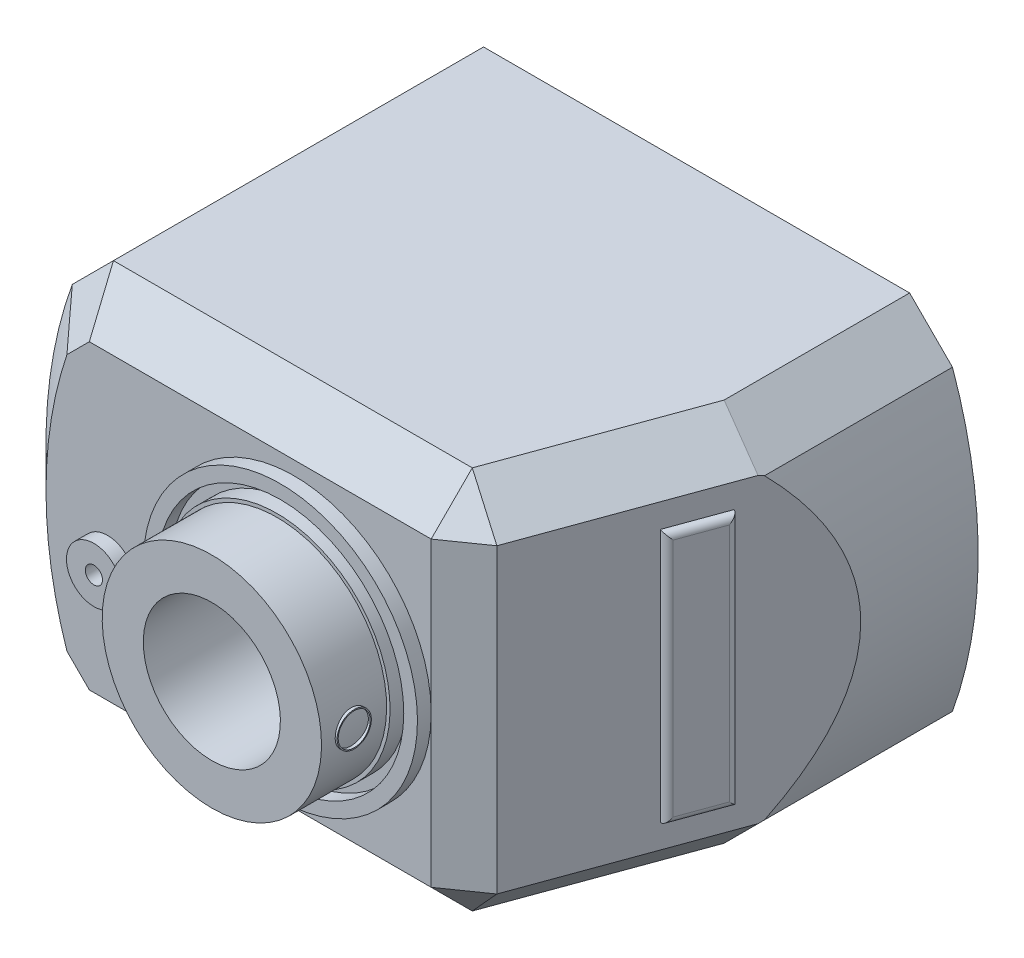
ISO-10303-21;
HEADER;
FILE_DESCRIPTION(('STEP AP214'),'2;1');
FILE_NAME('part.step','',(''),(''),'','','');
FILE_SCHEMA(('AUTOMOTIVE_DESIGN { 1 0 10303 214 1 1 1 1 }'));
ENDSEC;
DATA;
#1=APPLICATION_CONTEXT('core data for automotive mechanical design processes');
#2=APPLICATION_PROTOCOL_DEFINITION('international standard','automotive_design',2000,#1);
#3=PRODUCT_CONTEXT('',#1,'mechanical');
#4=PRODUCT('Part','Part','',(#3));
#5=PRODUCT_RELATED_PRODUCT_CATEGORY('part','',(#4));
#6=PRODUCT_DEFINITION_FORMATION('','',#4);
#7=PRODUCT_DEFINITION_CONTEXT('part definition',#1,'design');
#8=PRODUCT_DEFINITION('design','',#6,#7);
#9=PRODUCT_DEFINITION_SHAPE('','',#8);
#10=(LENGTH_UNIT() NAMED_UNIT(*) SI_UNIT(.MILLI.,.METRE.));
#11=(NAMED_UNIT(*) PLANE_ANGLE_UNIT() SI_UNIT($,.RADIAN.));
#12=(NAMED_UNIT(*) SI_UNIT($,.STERADIAN.) SOLID_ANGLE_UNIT());
#13=UNCERTAINTY_MEASURE_WITH_UNIT(LENGTH_MEASURE(1.E-05),#10,'distance_accuracy_value','');
#14=(GEOMETRIC_REPRESENTATION_CONTEXT(3) GLOBAL_UNCERTAINTY_ASSIGNED_CONTEXT((#13)) GLOBAL_UNIT_ASSIGNED_CONTEXT((#10,
#11,#12)) REPRESENTATION_CONTEXT('',''));
#15=CARTESIAN_POINT('',(0.,0.,0.));
#16=DIRECTION('',(0.,0.,1.));
#17=DIRECTION('',(1.,0.,0.));
#18=AXIS2_PLACEMENT_3D('',#15,#16,#17);
#19=CARTESIAN_POINT('',(24.1995958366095,28.,60.));
#20=DIRECTION('',(-0.939692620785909,0.,-0.342020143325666));
#21=DIRECTION('',(0.342020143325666,0.,-0.939692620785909));
#22=AXIS2_PLACEMENT_3D('',#19,#20,#21);
#23=PLANE('',#22);
#24=DIRECTION('',(0.,-1.,0.));
#25=VECTOR('',#24,1.);
#26=CARTESIAN_POINT('',(25.636506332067,-28.,56.0521208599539));
#27=LINE('',#26,#25);
#28=CARTESIAN_POINT('',(25.636506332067,22.,56.0521208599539));
#29=VERTEX_POINT('',#28);
#30=CARTESIAN_POINT('',(25.636506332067,-22.,56.0521208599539));
#31=VERTEX_POINT('',#30);
#32=EDGE_CURVE('E377',#29,#31,#27,.T.);
#33=ORIENTED_EDGE('',*,*,#32,.T.);
#34=DIRECTION('',(0.342020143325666,0.,-0.939692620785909));
#35=VECTOR('',#34,1.);
#36=CARTESIAN_POINT('',(24.1995958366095,-22.,60.));
#37=LINE('',#36,#35);
#38=CARTESIAN_POINT('',(35.802746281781,-22.,28.1206061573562));
#39=VERTEX_POINT('',#38);
#40=EDGE_CURVE('E379',#31,#39,#37,.T.);
#41=ORIENTED_EDGE('',*,*,#40,.T.);
#42=DIRECTION('',(-0.323615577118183,-0.323615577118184,0.88912649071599));
#43=VECTOR('',#42,1.);
#44=CARTESIAN_POINT('',(25.3731985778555,-32.4295477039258,56.7755529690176));
#45=LINE('',#44,#43);
#46=CARTESIAN_POINT('',(36.0574925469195,-21.7452537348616,27.4206965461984));
#47=VERTEX_POINT('',#46);
#48=EDGE_CURVE('E308',#47,#39,#45,.T.);
#49=ORIENTED_EDGE('',*,*,#48,.F.);
#50=CARTESIAN_POINT('',(-25.197253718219,0.,195.71672874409));
#51=DIRECTION('',(-0.939692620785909,0.,-0.342020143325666));
#52=DIRECTION('',(0.342020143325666,0.,-0.939692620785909));
#53=AXIS2_PLACEMENT_3D('',#50,#51,#52);
#54=ELLIPSE('',#53,190.047286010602,65.);
#55=CARTESIAN_POINT('',(36.0574925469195,21.7452537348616,27.4206965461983));
#56=VERTEX_POINT('',#55);
#57=EDGE_CURVE('E305',#56,#47,#54,.T.);
#58=ORIENTED_EDGE('',*,*,#57,.F.);
#59=DIRECTION('',(-0.323615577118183,0.323615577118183,0.88912649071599));
#60=VECTOR('',#59,1.);
#61=CARTESIAN_POINT('',(25.3731985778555,32.4295477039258,56.7755529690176));
#62=LINE('',#61,#60);
#63=CARTESIAN_POINT('',(35.802746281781,22.,28.1206061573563));
#64=VERTEX_POINT('',#63);
#65=EDGE_CURVE('E302',#56,#64,#62,.T.);
#66=ORIENTED_EDGE('',*,*,#65,.T.);
#67=DIRECTION('',(-0.342020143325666,0.,0.939692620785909));
#68=VECTOR('',#67,1.);
#69=CARTESIAN_POINT('',(24.1995958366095,22.,60.));
#70=LINE('',#69,#68);
#71=EDGE_CURVE('E375',#64,#29,#70,.T.);
#72=ORIENTED_EDGE('',*,*,#71,.T.);
#73=EDGE_LOOP('',(#33,#41,#49,#58,#66,#72));
#74=FACE_BOUND('',#73,.T.);
#75=DIRECTION('',(-0.342020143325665,0.,0.93969262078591));
#76=VECTOR('',#75,1.);
#77=CARTESIAN_POINT('',(34.87105020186,18.5,30.6804200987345));
#78=LINE('',#77,#76);
#79=CARTESIAN_POINT('',(34.87105020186,18.5,30.6804200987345));
#80=VERTEX_POINT('',#79);
#81=CARTESIAN_POINT('',(32.0017748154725,18.5,38.5636894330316));
#82=VERTEX_POINT('',#81);
#83=EDGE_CURVE('E148',#80,#82,#78,.T.);
#84=ORIENTED_EDGE('',*,*,#83,.F.);
#85=DIRECTION('',(0.,-1.,0.));
#86=VECTOR('',#85,1.);
#87=CARTESIAN_POINT('',(34.87105020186,18.5,30.6804200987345));
#88=LINE('',#87,#86);
#89=CARTESIAN_POINT('',(34.87105020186,-18.5,30.6804200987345));
#90=VERTEX_POINT('',#89);
#91=EDGE_CURVE('E167',#80,#90,#88,.T.);
#92=ORIENTED_EDGE('',*,*,#91,.T.);
#93=DIRECTION('',(0.342020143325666,0.,-0.939692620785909));
#94=VECTOR('',#93,1.);
#95=CARTESIAN_POINT('',(32.0017748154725,-18.5,38.5636894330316));
#96=LINE('',#95,#94);
#97=CARTESIAN_POINT('',(32.0017748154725,-18.5,38.5636894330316));
#98=VERTEX_POINT('',#97);
#99=EDGE_CURVE('E150',#98,#90,#96,.T.);
#100=ORIENTED_EDGE('',*,*,#99,.F.);
#101=DIRECTION('',(0.,1.,0.));
#102=VECTOR('',#101,1.);
#103=CARTESIAN_POINT('',(32.0017748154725,-18.5,38.5636894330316));
#104=LINE('',#103,#102);
#105=EDGE_CURVE('E144',#98,#82,#104,.T.);
#106=ORIENTED_EDGE('',*,*,#105,.T.);
#107=EDGE_LOOP('',(#84,#92,#100,#106));
#108=FACE_BOUND('',#107,.T.);
#109=ADVANCED_FACE('F14',(#74,#108),#23,.F.);
#110=CARTESIAN_POINT('',(22.802746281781,0.,0.));
#111=DIRECTION('',(0.,0.,1.));
#112=DIRECTION('',(0.,-1.,0.));
#113=AXIS2_PLACEMENT_3D('',#110,#111,#112);
#114=PLANE('',#113);
#115=CARTESIAN_POINT('',(0.,0.,0.));
#116=DIRECTION('',(0.,0.,-1.));
#117=DIRECTION('',(0.,1.,0.));
#118=AXIS2_PLACEMENT_3D('',#115,#116,#117);
#119=CIRCLE('',#118,18.5);
#120=CARTESIAN_POINT('',(0.,18.5,0.));
#121=VERTEX_POINT('',#120);
#122=EDGE_CURVE('E190',#121,#121,#119,.T.);
#123=ORIENTED_EDGE('',*,*,#122,.F.);
#124=EDGE_LOOP('',(#123));
#125=FACE_BOUND('',#124,.T.);
#126=CARTESIAN_POINT('',(22.802746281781,0.,0.));
#127=DIRECTION('',(0.,0.,1.));
#128=DIRECTION('',(0.,-1.,0.));
#129=AXIS2_PLACEMENT_3D('',#126,#127,#128);
#130=CIRCLE('',#129,65.);
#131=CARTESIAN_POINT('',(-38.360968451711,22.,0.));
#132=VERTEX_POINT('',#131);
#133=CARTESIAN_POINT('',(-38.360968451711,-22.,0.));
#134=VERTEX_POINT('',#133);
#135=EDGE_CURVE('E311',#132,#134,#130,.T.);
#136=ORIENTED_EDGE('',*,*,#135,.F.);
#137=DIRECTION('',(0.707106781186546,0.707106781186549,0.));
#138=VECTOR('',#137,1.);
#139=CARTESIAN_POINT('',(-38.360968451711,22.,0.));
#140=LINE('',#139,#138);
#141=CARTESIAN_POINT('',(-32.360968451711,28.,0.));
#142=VERTEX_POINT('',#141);
#143=EDGE_CURVE('E332',#132,#142,#140,.T.);
#144=ORIENTED_EDGE('',*,*,#143,.T.);
#145=DIRECTION('',(-1.,0.,0.));
#146=VECTOR('',#145,1.);
#147=CARTESIAN_POINT('',(29.802746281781,28.,0.));
#148=LINE('',#147,#146);
#149=CARTESIAN_POINT('',(29.802746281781,28.,0.));
#150=VERTEX_POINT('',#149);
#151=EDGE_CURVE('E329',#150,#142,#148,.T.);
#152=ORIENTED_EDGE('',*,*,#151,.F.);
#153=DIRECTION('',(0.707106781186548,-0.707106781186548,0.));
#154=VECTOR('',#153,1.);
#155=CARTESIAN_POINT('',(29.802746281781,28.,0.));
#156=LINE('',#155,#154);
#157=CARTESIAN_POINT('',(36.0574925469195,21.7452537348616,0.));
#158=VERTEX_POINT('',#157);
#159=EDGE_CURVE('E326',#150,#158,#156,.T.);
#160=ORIENTED_EDGE('',*,*,#159,.T.);
#161=CARTESIAN_POINT('',(-25.197253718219,0.,0.));
#162=DIRECTION('',(0.,0.,1.));
#163=DIRECTION('',(0.,-1.,0.));
#164=AXIS2_PLACEMENT_3D('',#161,#162,#163);
#165=CIRCLE('',#164,65.);
#166=CARTESIAN_POINT('',(36.0574925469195,-21.7452537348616,0.));
#167=VERTEX_POINT('',#166);
#168=EDGE_CURVE('E323',#167,#158,#165,.T.);
#169=ORIENTED_EDGE('',*,*,#168,.F.);
#170=DIRECTION('',(0.707106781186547,0.707106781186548,0.));
#171=VECTOR('',#170,1.);
#172=CARTESIAN_POINT('',(29.802746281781,-28.,0.));
#173=LINE('',#172,#171);
#174=CARTESIAN_POINT('',(29.802746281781,-28.,0.));
#175=VERTEX_POINT('',#174);
#176=EDGE_CURVE('E320',#175,#167,#173,.T.);
#177=ORIENTED_EDGE('',*,*,#176,.F.);
#178=DIRECTION('',(1.,0.,0.));
#179=VECTOR('',#178,1.);
#180=CARTESIAN_POINT('',(-32.360968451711,-28.,0.));
#181=LINE('',#180,#179);
#182=CARTESIAN_POINT('',(-32.360968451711,-28.,0.));
#183=VERTEX_POINT('',#182);
#184=EDGE_CURVE('E317',#183,#175,#181,.T.);
#185=ORIENTED_EDGE('',*,*,#184,.F.);
#186=DIRECTION('',(0.707106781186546,-0.707106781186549,0.));
#187=VECTOR('',#186,1.);
#188=CARTESIAN_POINT('',(-38.360968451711,-22.,0.));
#189=LINE('',#188,#187);
#190=EDGE_CURVE('E314',#134,#183,#189,.T.);
#191=ORIENTED_EDGE('',*,*,#190,.F.);
#192=EDGE_LOOP('',(#136,#144,#152,#160,#169,#177,#185,#191));
#193=FACE_BOUND('',#192,.T.);
#194=CARTESIAN_POINT('',(30.,-0.7369333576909,0.));
#195=DIRECTION('',(0.,0.,1.));
#196=DIRECTION('',(0.,-1.,0.));
#197=AXIS2_PLACEMENT_3D('',#194,#195,#196);
#198=CIRCLE('',#197,3.);
#199=CARTESIAN_POINT('',(30.,-3.7369333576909,0.));
#200=VERTEX_POINT('',#199);
#201=EDGE_CURVE('E184',#200,#200,#198,.T.);
#202=ORIENTED_EDGE('',*,*,#201,.T.);
#203=EDGE_LOOP('',(#202));
#204=FACE_BOUND('',#203,.T.);
#205=CARTESIAN_POINT('',(11.5,-22.6395601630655,0.));
#206=DIRECTION('',(0.,0.,-1.));
#207=DIRECTION('',(0.,1.,0.));
#208=AXIS2_PLACEMENT_3D('',#205,#206,#207);
#209=CIRCLE('',#208,2.25);
#210=CARTESIAN_POINT('',(11.5,-20.3895601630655,0.));
#211=VERTEX_POINT('',#210);
#212=EDGE_CURVE('E175',#211,#211,#209,.T.);
#213=ORIENTED_EDGE('',*,*,#212,.F.);
#214=EDGE_LOOP('',(#213));
#215=FACE_BOUND('',#214,.T.);
#216=CARTESIAN_POINT('',(11.5,22.3604398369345,0.));
#217=DIRECTION('',(0.,0.,1.));
#218=DIRECTION('',(0.,-1.,0.));
#219=AXIS2_PLACEMENT_3D('',#216,#217,#218);
#220=CIRCLE('',#219,2.25);
#221=CARTESIAN_POINT('',(11.5,20.1104398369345,0.));
#222=VERTEX_POINT('',#221);
#223=EDGE_CURVE('E169',#222,#222,#220,.T.);
#224=ORIENTED_EDGE('',*,*,#223,.T.);
#225=EDGE_LOOP('',(#224));
#226=FACE_BOUND('',#225,.T.);
#227=ADVANCED_FACE('F440',(#125,#193,#204,#215,#226),#114,.F.);
#228=CARTESIAN_POINT('',(0.,0.,0.));
#229=DIRECTION('',(0.,0.,1.));
#230=DIRECTION('',(0.,-1.,0.));
#231=AXIS2_PLACEMENT_3D('',#228,#229,#230);
#232=CYLINDRICAL_SURFACE('',#231,10.);
#233=CARTESIAN_POINT('',(0.,0.,72.));
#234=DIRECTION('',(0.,0.,1.));
#235=DIRECTION('',(0.,-1.,0.));
#236=AXIS2_PLACEMENT_3D('',#233,#234,#235);
#237=CIRCLE('',#236,10.);
#238=CARTESIAN_POINT('',(0.,-10.,72.));
#239=VERTEX_POINT('',#238);
#240=EDGE_CURVE('E212',#239,#239,#237,.T.);
#241=ORIENTED_EDGE('',*,*,#240,.T.);
#242=EDGE_LOOP('',(#241));
#243=FACE_BOUND('',#242,.T.);
#244=CARTESIAN_POINT('',(0.,0.,15.));
#245=DIRECTION('',(0.,0.,-1.));
#246=DIRECTION('',(0.,1.,0.));
#247=AXIS2_PLACEMENT_3D('',#244,#245,#246);
#248=CIRCLE('',#247,10.);
#249=CARTESIAN_POINT('',(0.,10.,15.));
#250=VERTEX_POINT('',#249);
#251=EDGE_CURVE('E187',#250,#250,#248,.T.);
#252=ORIENTED_EDGE('',*,*,#251,.T.);
#253=EDGE_LOOP('',(#252));
#254=FACE_BOUND('',#253,.T.);
#255=ADVANCED_FACE('F446',(#243,#254),#232,.F.);
#256=CARTESIAN_POINT('',(22.802746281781,0.,60.));
#257=DIRECTION('',(0.,0.,1.));
#258=DIRECTION('',(0.,-1.,0.));
#259=AXIS2_PLACEMENT_3D('',#256,#257,#258);
#260=PLANE('',#259);
#261=CARTESIAN_POINT('',(0.,0.,60.));
#262=DIRECTION('',(0.,0.,1.));
#263=DIRECTION('',(0.,-1.,0.));
#264=AXIS2_PLACEMENT_3D('',#261,#262,#263);
#265=CIRCLE('',#264,20.);
#266=CARTESIAN_POINT('',(19.9983506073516,0.256852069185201,60.));
#267=VERTEX_POINT('',#266);
#268=CARTESIAN_POINT('',(19.9983506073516,-0.256852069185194,60.));
#269=VERTEX_POINT('',#268);
#270=EDGE_CURVE('E237',#267,#269,#265,.T.);
#271=ORIENTED_EDGE('',*,*,#270,.F.);
#272=DIRECTION('',(0.,1.,0.));
#273=VECTOR('',#272,1.);
#274=CARTESIAN_POINT('',(19.9983506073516,28.,60.));
#275=LINE('',#274,#273);
#276=CARTESIAN_POINT('',(19.9983506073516,22.,60.));
#277=VERTEX_POINT('',#276);
#278=EDGE_CURVE('E362',#267,#277,#275,.T.);
#279=ORIENTED_EDGE('',*,*,#278,.T.);
#280=DIRECTION('',(-1.,0.,0.));
#281=VECTOR('',#280,1.);
#282=CARTESIAN_POINT('',(-32.360968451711,22.,60.));
#283=LINE('',#282,#281);
#284=CARTESIAN_POINT('',(-29.8756870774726,22.,60.));
#285=VERTEX_POINT('',#284);
#286=EDGE_CURVE('E357',#277,#285,#283,.T.);
#287=ORIENTED_EDGE('',*,*,#286,.T.);
#288=DIRECTION('',(-0.707106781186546,-0.707106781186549,0.));
#289=VECTOR('',#288,1.);
#290=CARTESIAN_POINT('',(-14.5364703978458,37.3392166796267,60.));
#291=LINE('',#290,#289);
#292=CARTESIAN_POINT('',(-33.1451484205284,18.7305386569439,60.));
#293=VERTEX_POINT('',#292);
#294=EDGE_CURVE('E351',#285,#293,#291,.T.);
#295=ORIENTED_EDGE('',*,*,#294,.T.);
#296=CARTESIAN_POINT('',(22.802746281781,0.,60.));
#297=DIRECTION('',(0.,0.,1.));
#298=DIRECTION('',(0.,-1.,0.));
#299=AXIS2_PLACEMENT_3D('',#296,#297,#298);
#300=CIRCLE('',#299,59.);
#301=CARTESIAN_POINT('',(-33.1451484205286,-18.7305386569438,60.));
#302=VERTEX_POINT('',#301);
#303=EDGE_CURVE('E353',#293,#302,#300,.T.);
#304=ORIENTED_EDGE('',*,*,#303,.T.);
#305=DIRECTION('',(0.707106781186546,-0.707106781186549,0.));
#306=VECTOR('',#305,1.);
#307=CARTESIAN_POINT('',(-28.1183277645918,-23.7573593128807,60.));
#308=LINE('',#307,#306);
#309=CARTESIAN_POINT('',(-29.8756870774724,-22.,60.));
#310=VERTEX_POINT('',#309);
#311=EDGE_CURVE('E355',#302,#310,#308,.T.);
#312=ORIENTED_EDGE('',*,*,#311,.T.);
#313=DIRECTION('',(1.,0.,0.));
#314=VECTOR('',#313,1.);
#315=CARTESIAN_POINT('',(24.1995958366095,-22.,60.));
#316=LINE('',#315,#314);
#317=CARTESIAN_POINT('',(19.9983506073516,-22.,60.));
#318=VERTEX_POINT('',#317);
#319=EDGE_CURVE('E359',#310,#318,#316,.T.);
#320=ORIENTED_EDGE('',*,*,#319,.T.);
#321=EDGE_CURVE('E363',#318,#269,#275,.T.);
#322=ORIENTED_EDGE('',*,*,#321,.T.);
#323=EDGE_LOOP('',(#271,#279,#287,#295,#304,#312,#320,#322));
#324=FACE_BOUND('',#323,.T.);
#325=CARTESIAN_POINT('',(-27.209108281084,-5.13956016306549,60.));
#326=DIRECTION('',(0.,0.,1.));
#327=DIRECTION('',(0.,-1.,0.));
#328=AXIS2_PLACEMENT_3D('',#325,#326,#327);
#329=CIRCLE('',#328,4.);
#330=CARTESIAN_POINT('',(-27.209108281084,-9.13956016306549,60.));
#331=VERTEX_POINT('',#330);
#332=EDGE_CURVE('E199',#331,#331,#329,.T.);
#333=ORIENTED_EDGE('',*,*,#332,.F.);
#334=EDGE_LOOP('',(#333));
#335=FACE_BOUND('',#334,.T.);
#336=ADVANCED_FACE('F463',(#324,#335),#260,.T.);
#337=CARTESIAN_POINT('',(0.,0.,60.));
#338=DIRECTION('',(0.,0.,1.));
#339=DIRECTION('',(0.,-1.,0.));
#340=AXIS2_PLACEMENT_3D('',#337,#338,#339);
#341=CIRCLE('',#340,18.);
#342=CARTESIAN_POINT('',(0.,-18.,60.));
#343=VERTEX_POINT('',#342);
#344=EDGE_CURVE('E227',#343,#343,#341,.T.);
#345=ORIENTED_EDGE('',*,*,#344,.T.);
#346=EDGE_LOOP('',(#345));
#347=FACE_BOUND('',#346,.T.);
#348=CARTESIAN_POINT('',(0.,0.,60.));
#349=DIRECTION('',(0.,0.,1.));
#350=DIRECTION('',(0.,-1.,0.));
#351=AXIS2_PLACEMENT_3D('',#348,#349,#350);
#352=CIRCLE('',#351,16.5);
#353=CARTESIAN_POINT('',(0.,-16.5,60.));
#354=VERTEX_POINT('',#353);
#355=EDGE_CURVE('E221',#354,#354,#352,.T.);
#356=ORIENTED_EDGE('',*,*,#355,.F.);
#357=EDGE_LOOP('',(#356));
#358=FACE_BOUND('',#357,.T.);
#359=ADVANCED_FACE('F464',(#347,#358),#260,.T.);
#360=CARTESIAN_POINT('',(22.802746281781,0.,60.));
#361=DIRECTION('',(0.,0.,-1.));
#362=DIRECTION('',(0.,1.,0.));
#363=AXIS2_PLACEMENT_3D('',#360,#361,#362);
#364=CYLINDRICAL_SURFACE('',#363,65.);
#365=DIRECTION('',(0.,0.,-1.));
#366=VECTOR('',#365,1.);
#367=CARTESIAN_POINT('',(-38.360968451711,-22.,60.));
#368=LINE('',#367,#366);
#369=CARTESIAN_POINT('',(-38.360968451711,-22.,54.));
#370=VERTEX_POINT('',#369);
#371=EDGE_CURVE('E349',#370,#134,#368,.T.);
#372=ORIENTED_EDGE('',*,*,#371,.F.);
#373=CARTESIAN_POINT('',(22.802746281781,0.,54.));
#374=DIRECTION('',(0.,0.,1.));
#375=DIRECTION('',(0.,-1.,0.));
#376=AXIS2_PLACEMENT_3D('',#373,#374,#375);
#377=CIRCLE('',#376,65.);
#378=CARTESIAN_POINT('',(-38.360968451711,22.,54.));
#379=VERTEX_POINT('',#378);
#380=EDGE_CURVE('E383',#370,#379,#377,.F.);
#381=ORIENTED_EDGE('',*,*,#380,.T.);
#382=DIRECTION('',(0.,0.,-1.));
#383=VECTOR('',#382,1.);
#384=CARTESIAN_POINT('',(-38.360968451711,22.,60.));
#385=LINE('',#384,#383);
#386=EDGE_CURVE('E335',#379,#132,#385,.T.);
#387=ORIENTED_EDGE('',*,*,#386,.T.);
#388=ORIENTED_EDGE('',*,*,#135,.T.);
#389=EDGE_LOOP('',(#372,#381,#387,#388));
#390=FACE_BOUND('',#389,.T.);
#391=ADVANCED_FACE('F466',(#390),#364,.T.);
#392=CARTESIAN_POINT('',(-38.360968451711,-22.,60.));
#393=DIRECTION('',(0.707106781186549,0.707106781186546,0.));
#394=DIRECTION('',(-0.707106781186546,0.707106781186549,0.));
#395=AXIS2_PLACEMENT_3D('',#392,#393,#394);
#396=PLANE('',#395);
#397=DIRECTION('',(0.,0.,-1.));
#398=VECTOR('',#397,1.);
#399=CARTESIAN_POINT('',(-32.360968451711,-28.,60.));
#400=LINE('',#399,#398);
#401=CARTESIAN_POINT('',(-32.360968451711,-28.,54.));
#402=VERTEX_POINT('',#401);
#403=EDGE_CURVE('E347',#402,#183,#400,.T.);
#404=ORIENTED_EDGE('',*,*,#403,.F.);
#405=DIRECTION('',(-0.707106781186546,0.707106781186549,0.));
#406=VECTOR('',#405,1.);
#407=CARTESIAN_POINT('',(-38.360968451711,-22.,54.));
#408=LINE('',#407,#406);
#409=EDGE_CURVE('E381',#402,#370,#408,.T.);
#410=ORIENTED_EDGE('',*,*,#409,.T.);
#411=ORIENTED_EDGE('',*,*,#371,.T.);
#412=ORIENTED_EDGE('',*,*,#190,.T.);
#413=EDGE_LOOP('',(#404,#410,#411,#412));
#414=FACE_BOUND('',#413,.T.);
#415=ADVANCED_FACE('F16',(#414),#396,.F.);
#416=CARTESIAN_POINT('',(-32.360968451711,-28.,60.));
#417=DIRECTION('',(0.,1.,0.));
#418=DIRECTION('',(-1.,0.,0.));
#419=AXIS2_PLACEMENT_3D('',#416,#417,#418);
#420=PLANE('',#419);
#421=DIRECTION('',(-0.342020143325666,0.,0.939692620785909));
#422=VECTOR('',#421,1.);
#423=CARTESIAN_POINT('',(11.945110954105,-28.,76.1260941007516));
#424=LINE('',#423,#422);
#425=CARTESIAN_POINT('',(29.802746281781,-28.,27.0626442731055));
#426=VERTEX_POINT('',#425);
#427=CARTESIAN_POINT('',(19.9983506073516,-28.,54.));
#428=VERTEX_POINT('',#427);
#429=EDGE_CURVE('E365',#426,#428,#424,.T.);
#430=ORIENTED_EDGE('',*,*,#429,.T.);
#431=DIRECTION('',(-1.,0.,0.));
#432=VECTOR('',#431,1.);
#433=CARTESIAN_POINT('',(-32.360968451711,-28.,54.));
#434=LINE('',#433,#432);
#435=EDGE_CURVE('E368',#428,#402,#434,.T.);
#436=ORIENTED_EDGE('',*,*,#435,.T.);
#437=ORIENTED_EDGE('',*,*,#403,.T.);
#438=ORIENTED_EDGE('',*,*,#184,.T.);
#439=DIRECTION('',(0.,0.,-1.));
#440=VECTOR('',#439,1.);
#441=CARTESIAN_POINT('',(29.802746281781,-28.,60.));
#442=LINE('',#441,#440);
#443=EDGE_CURVE('E345',#426,#175,#442,.T.);
#444=ORIENTED_EDGE('',*,*,#443,.F.);
#445=EDGE_LOOP('',(#430,#436,#437,#438,#444));
#446=FACE_BOUND('',#445,.T.);
#447=ADVANCED_FACE('F488',(#446),#420,.F.);
#448=CARTESIAN_POINT('',(29.802746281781,-28.,60.));
#449=DIRECTION('',(-0.707106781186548,0.707106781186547,0.));
#450=DIRECTION('',(-0.707106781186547,-0.707106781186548,0.));
#451=AXIS2_PLACEMENT_3D('',#448,#449,#450);
#452=PLANE('',#451);
#453=ORIENTED_EDGE('',*,*,#48,.T.);
#454=DIRECTION('',(0.701673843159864,0.701673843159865,0.123724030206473));
#455=VECTOR('',#454,1.);
#456=CARTESIAN_POINT('',(32.857554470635,-24.9451918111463,27.6012893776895));
#457=LINE('',#456,#455);
#458=EDGE_CURVE('E387',#39,#426,#457,.F.);
#459=ORIENTED_EDGE('',*,*,#458,.T.);
#460=ORIENTED_EDGE('',*,*,#443,.T.);
#461=ORIENTED_EDGE('',*,*,#176,.T.);
#462=DIRECTION('',(0.,0.,-1.));
#463=VECTOR('',#462,1.);
#464=CARTESIAN_POINT('',(36.0574925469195,-21.7452537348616,60.));
#465=LINE('',#464,#463);
#466=EDGE_CURVE('E343',#47,#167,#465,.T.);
#467=ORIENTED_EDGE('',*,*,#466,.F.);
#468=EDGE_LOOP('',(#453,#459,#460,#461,#467));
#469=FACE_BOUND('',#468,.T.);
#470=ADVANCED_FACE('F485',(#469),#452,.F.);
#471=CARTESIAN_POINT('',(-25.197253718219,0.,60.));
#472=DIRECTION('',(0.,0.,-1.));
#473=DIRECTION('',(0.,1.,0.));
#474=AXIS2_PLACEMENT_3D('',#471,#472,#473);
#475=CYLINDRICAL_SURFACE('',#474,65.);
#476=DIRECTION('',(0.,0.,-1.));
#477=VECTOR('',#476,1.);
#478=CARTESIAN_POINT('',(36.0574925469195,21.7452537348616,60.));
#479=LINE('',#478,#477);
#480=EDGE_CURVE('E341',#56,#158,#479,.T.);
#481=ORIENTED_EDGE('',*,*,#480,.F.);
#482=ORIENTED_EDGE('',*,*,#57,.T.);
#483=ORIENTED_EDGE('',*,*,#466,.T.);
#484=ORIENTED_EDGE('',*,*,#168,.T.);
#485=EDGE_LOOP('',(#481,#482,#483,#484));
#486=FACE_BOUND('',#485,.T.);
#487=ADVANCED_FACE('F481',(#486),#475,.T.);
#488=CARTESIAN_POINT('',(29.802746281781,28.,60.));
#489=DIRECTION('',(0.707106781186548,0.707106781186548,0.));
#490=DIRECTION('',(-0.707106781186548,0.707106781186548,0.));
#491=AXIS2_PLACEMENT_3D('',#488,#489,#490);
#492=PLANE('',#491);
#493=DIRECTION('',(0.,0.,-1.));
#494=VECTOR('',#493,1.);
#495=CARTESIAN_POINT('',(29.802746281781,28.,60.));
#496=LINE('',#495,#494);
#497=CARTESIAN_POINT('',(29.802746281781,28.,27.0626442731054));
#498=VERTEX_POINT('',#497);
#499=EDGE_CURVE('E339',#498,#150,#496,.T.);
#500=ORIENTED_EDGE('',*,*,#499,.F.);
#501=DIRECTION('',(-0.701673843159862,0.701673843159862,-0.123724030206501));
#502=VECTOR('',#501,1.);
#503=CARTESIAN_POINT('',(32.662167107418,25.1405791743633,27.566837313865));
#504=LINE('',#503,#502);
#505=EDGE_CURVE('E389',#498,#64,#504,.F.);
#506=ORIENTED_EDGE('',*,*,#505,.T.);
#507=ORIENTED_EDGE('',*,*,#65,.F.);
#508=ORIENTED_EDGE('',*,*,#480,.T.);
#509=ORIENTED_EDGE('',*,*,#159,.F.);
#510=EDGE_LOOP('',(#500,#506,#507,#508,#509));
#511=FACE_BOUND('',#510,.T.);
#512=ADVANCED_FACE('F477',(#511),#492,.T.);
#513=CARTESIAN_POINT('',(29.802746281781,28.,60.));
#514=DIRECTION('',(0.,-1.,0.));
#515=DIRECTION('',(1.,0.,0.));
#516=AXIS2_PLACEMENT_3D('',#513,#514,#515);
#517=PLANE('',#516);
#518=DIRECTION('',(0.,0.,-1.));
#519=VECTOR('',#518,1.);
#520=CARTESIAN_POINT('',(-32.360968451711,28.,60.));
#521=LINE('',#520,#519);
#522=CARTESIAN_POINT('',(-32.360968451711,28.,54.));
#523=VERTEX_POINT('',#522);
#524=EDGE_CURVE('E337',#523,#142,#521,.T.);
#525=ORIENTED_EDGE('',*,*,#524,.F.);
#526=DIRECTION('',(1.,0.,0.));
#527=VECTOR('',#526,1.);
#528=CARTESIAN_POINT('',(24.1995958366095,28.,54.));
#529=LINE('',#528,#527);
#530=CARTESIAN_POINT('',(19.9983506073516,28.,54.));
#531=VERTEX_POINT('',#530);
#532=EDGE_CURVE('E373',#523,#531,#529,.T.);
#533=ORIENTED_EDGE('',*,*,#532,.T.);
#534=DIRECTION('',(0.342020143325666,0.,-0.939692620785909));
#535=VECTOR('',#534,1.);
#536=CARTESIAN_POINT('',(19.2168842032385,28.,56.1470612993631));
#537=LINE('',#536,#535);
#538=EDGE_CURVE('E371',#531,#498,#537,.T.);
#539=ORIENTED_EDGE('',*,*,#538,.T.);
#540=ORIENTED_EDGE('',*,*,#499,.T.);
#541=ORIENTED_EDGE('',*,*,#151,.T.);
#542=EDGE_LOOP('',(#525,#533,#539,#540,#541));
#543=FACE_BOUND('',#542,.T.);
#544=ADVANCED_FACE('F473',(#543),#517,.F.);
#545=CARTESIAN_POINT('',(-38.360968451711,22.,60.));
#546=DIRECTION('',(-0.707106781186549,0.707106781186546,0.));
#547=DIRECTION('',(-0.707106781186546,-0.707106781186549,0.));
#548=AXIS2_PLACEMENT_3D('',#545,#546,#547);
#549=PLANE('',#548);
#550=ORIENTED_EDGE('',*,*,#386,.F.);
#551=DIRECTION('',(0.707106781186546,0.707106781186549,0.));
#552=VECTOR('',#551,1.);
#553=CARTESIAN_POINT('',(-38.360968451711,22.,54.));
#554=LINE('',#553,#552);
#555=EDGE_CURVE('E385',#379,#523,#554,.T.);
#556=ORIENTED_EDGE('',*,*,#555,.T.);
#557=ORIENTED_EDGE('',*,*,#524,.T.);
#558=ORIENTED_EDGE('',*,*,#143,.F.);
#559=EDGE_LOOP('',(#550,#556,#557,#558));
#560=FACE_BOUND('',#559,.T.);
#561=ADVANCED_FACE('F470',(#560),#549,.T.);
#562=CARTESIAN_POINT('',(22.802746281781,22.,60.));
#563=DIRECTION('',(0.,0.707106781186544,0.707106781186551));
#564=DIRECTION('',(0.,-0.707106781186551,0.707106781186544));
#565=AXIS2_PLACEMENT_3D('',#562,#563,#564);
#566=PLANE('',#565);
#567=DIRECTION('',(0.,-0.707106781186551,0.707106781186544));
#568=VECTOR('',#567,1.);
#569=CARTESIAN_POINT('',(19.9983506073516,28.,54.));
#570=LINE('',#569,#568);
#571=EDGE_CURVE('E296',#531,#277,#570,.T.);
#572=ORIENTED_EDGE('',*,*,#571,.F.);
#573=ORIENTED_EDGE('',*,*,#532,.F.);
#574=DIRECTION('',(0.281084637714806,-0.678598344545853,0.678598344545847));
#575=VECTOR('',#574,1.);
#576=CARTESIAN_POINT('',(-31.6905584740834,26.381487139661,55.6185128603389));
#577=LINE('',#576,#575);
#578=EDGE_CURVE('E299',#285,#523,#577,.F.);
#579=ORIENTED_EDGE('',*,*,#578,.F.);
#580=ORIENTED_EDGE('',*,*,#286,.F.);
#581=EDGE_LOOP('',(#572,#573,#579,#580));
#582=FACE_BOUND('',#581,.T.);
#583=ADVANCED_FACE('F451',(#582),#566,.T.);
#584=CARTESIAN_POINT('',(19.2168842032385,28.,56.1470612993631));
#585=DIRECTION('',(-0.664463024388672,-0.707106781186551,-0.241844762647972));
#586=DIRECTION('',(0.728739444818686,-0.684791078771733,0.));
#587=AXIS2_PLACEMENT_3D('',#584,#585,#586);
#588=PLANE('',#587);
#589=ORIENTED_EDGE('',*,*,#505,.F.);
#590=ORIENTED_EDGE('',*,*,#538,.F.);
#591=DIRECTION('',(0.664463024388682,-0.707106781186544,0.241844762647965));
#592=VECTOR('',#591,1.);
#593=CARTESIAN_POINT('',(19.9983506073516,28.,54.));
#594=LINE('',#593,#592);
#595=EDGE_CURVE('E293',#29,#531,#594,.F.);
#596=ORIENTED_EDGE('',*,*,#595,.F.);
#597=ORIENTED_EDGE('',*,*,#71,.F.);
#598=EDGE_LOOP('',(#589,#590,#596,#597));
#599=FACE_BOUND('',#598,.T.);
#600=ADVANCED_FACE('F283',(#599),#588,.F.);
#601=CARTESIAN_POINT('',(-38.360968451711,22.,54.));
#602=DIRECTION('',(0.5,-0.5,-0.707106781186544));
#603=DIRECTION('',(0.816496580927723,0.,0.57735026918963));
#604=AXIS2_PLACEMENT_3D('',#601,#602,#603);
#605=PLANE('',#604);
#606=ORIENTED_EDGE('',*,*,#578,.T.);
#607=ORIENTED_EDGE('',*,*,#555,.F.);
#608=CARTESIAN_POINT('',(-38.360968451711,22.,54.));
#609=CARTESIAN_POINT('',(-37.9280573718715,21.7253560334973,54.5003169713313));
#610=CARTESIAN_POINT('',(-37.4947312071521,21.4512315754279,55.0005601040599));
#611=CARTESIAN_POINT('',(-36.6272204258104,20.9040636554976,56.0008890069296));
#612=CARTESIAN_POINT('',(-36.1930358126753,20.6310201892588,56.5009747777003));
#613=CARTESIAN_POINT('',(-35.3237761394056,20.0860538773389,57.5009835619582));
#614=CARTESIAN_POINT('',(-34.8887010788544,19.8141310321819,58.0009065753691));
#615=CARTESIAN_POINT('',(-34.0176261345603,19.2714499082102,59.0005830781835));
#616=CARTESIAN_POINT('',(-33.5816262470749,19.0006916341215,59.5003365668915));
#617=CARTESIAN_POINT('',(-33.1451484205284,18.7305386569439,60.));
#618=B_SPLINE_CURVE_WITH_KNOTS('',3,(#608,#609,#610,#611,#612,#613,#614,#615,#616,#617),
.UNSPECIFIED.,.F.,.F.,(4,2,2,2,4),(0.,2.14905205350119,4.29809539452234,6.44713974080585,
8.59619280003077),.UNSPECIFIED.);
#619=EDGE_CURVE('E286',#293,#379,#618,.F.);
#620=ORIENTED_EDGE('',*,*,#619,.F.);
#621=ORIENTED_EDGE('',*,*,#294,.F.);
#622=EDGE_LOOP('',(#606,#607,#620,#621));
#623=FACE_BOUND('',#622,.T.);
#624=ADVANCED_FACE('F278',(#623),#605,.F.);
#625=CARTESIAN_POINT('',(19.9983506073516,28.,54.));
#626=DIRECTION('',(0.44371260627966,0.633687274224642,0.633687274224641));
#627=DIRECTION('',(0.,-0.707106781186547,0.707106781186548));
#628=AXIS2_PLACEMENT_3D('',#625,#626,#627);
#629=PLANE('',#628);
#630=ORIENTED_EDGE('',*,*,#595,.T.);
#631=ORIENTED_EDGE('',*,*,#571,.T.);
#632=DIRECTION('',(0.819152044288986,0.,-0.573576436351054));
#633=VECTOR('',#632,1.);
#634=CARTESIAN_POINT('',(22.817428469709,22.,58.026060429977));
#635=LINE('',#634,#633);
#636=EDGE_CURVE('E259',#29,#277,#635,.F.);
#637=ORIENTED_EDGE('',*,*,#636,.F.);
#638=EDGE_LOOP('',(#630,#631,#637));
#639=FACE_BOUND('',#638,.T.);
#640=ADVANCED_FACE('F282',(#639),#629,.T.);
#641=CARTESIAN_POINT('',(22.802746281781,0.,60.));
#642=DIRECTION('',(0.,0.,-1.));
#643=DIRECTION('',(0.,1.,0.));
#644=AXIS2_PLACEMENT_3D('',#641,#642,#643);
#645=CONICAL_SURFACE('',#644,59.,0.785398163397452);
#646=ORIENTED_EDGE('',*,*,#619,.T.);
#647=ORIENTED_EDGE('',*,*,#380,.F.);
#648=CARTESIAN_POINT('',(-38.360968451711,-22.,54.));
#649=CARTESIAN_POINT('',(-37.9280573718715,-21.7253560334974,54.5003169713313));
#650=CARTESIAN_POINT('',(-37.4947312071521,-21.451231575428,55.0005601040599));
#651=CARTESIAN_POINT('',(-36.6272204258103,-20.9040636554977,56.0008890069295));
#652=CARTESIAN_POINT('',(-36.1930358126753,-20.6310201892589,56.5009747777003));
#653=CARTESIAN_POINT('',(-35.3237761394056,-20.0860538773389,57.5009835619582));
#654=CARTESIAN_POINT('',(-34.8887010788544,-19.814131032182,58.0009065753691));
#655=CARTESIAN_POINT('',(-34.0176261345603,-19.2714499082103,59.0005830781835));
#656=CARTESIAN_POINT('',(-33.5816262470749,-19.0006916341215,59.5003365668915));
#657=CARTESIAN_POINT('',(-33.1451484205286,-18.7305386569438,60.));
#658=B_SPLINE_CURVE_WITH_KNOTS('',3,(#648,#649,#650,#651,#652,#653,#654,#655,#656,#657),
.UNSPECIFIED.,.F.,.F.,(4,2,2,2,4),(0.,2.14905205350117,4.2980953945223,6.44713974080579,
8.59619280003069),.UNSPECIFIED.);
#659=EDGE_CURVE('E250',#302,#370,#658,.F.);
#660=ORIENTED_EDGE('',*,*,#659,.F.);
#661=ORIENTED_EDGE('',*,*,#303,.F.);
#662=EDGE_LOOP('',(#646,#647,#660,#661));
#663=FACE_BOUND('',#662,.T.);
#664=ADVANCED_FACE('F261',(#663),#645,.T.);
#665=CARTESIAN_POINT('',(25.636506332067,28.,56.0521208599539));
#666=DIRECTION('',(0.573576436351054,0.,0.819152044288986));
#667=DIRECTION('',(-0.819152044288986,0.,0.573576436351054));
#668=AXIS2_PLACEMENT_3D('',#665,#666,#667);
#669=PLANE('',#668);
#670=ORIENTED_EDGE('',*,*,#636,.T.);
#671=ORIENTED_EDGE('',*,*,#278,.F.);
#672=EDGE_CURVE('E366',#269,#267,#275,.T.);
#673=ORIENTED_EDGE('',*,*,#672,.F.);
#674=ORIENTED_EDGE('',*,*,#321,.F.);
#675=DIRECTION('',(-0.819152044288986,0.,0.573576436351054));
#676=VECTOR('',#675,1.);
#677=CARTESIAN_POINT('',(19.9983506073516,-22.,60.));
#678=LINE('',#677,#676);
#679=EDGE_CURVE('E247',#31,#318,#678,.T.);
#680=ORIENTED_EDGE('',*,*,#679,.F.);
#681=ORIENTED_EDGE('',*,*,#32,.F.);
#682=EDGE_LOOP('',(#670,#671,#673,#674,#680,#681));
#683=FACE_BOUND('',#682,.T.);
#684=ADVANCED_FACE('F273',(#683),#669,.T.);
#685=CARTESIAN_POINT('',(24.1995958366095,-22.,60.));
#686=DIRECTION('',(-0.664463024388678,0.707106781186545,-0.241844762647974));
#687=DIRECTION('',(-0.72873944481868,-0.684791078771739,0.));
#688=AXIS2_PLACEMENT_3D('',#685,#686,#687);
#689=PLANE('',#688);
#690=ORIENTED_EDGE('',*,*,#458,.F.);
#691=ORIENTED_EDGE('',*,*,#40,.F.);
#692=DIRECTION('',(-0.664463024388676,-0.70710678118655,-0.241844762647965));
#693=VECTOR('',#692,1.);
#694=CARTESIAN_POINT('',(23.781609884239,-23.973939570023,55.3769937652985));
#695=LINE('',#694,#693);
#696=EDGE_CURVE('E244',#428,#31,#695,.F.);
#697=ORIENTED_EDGE('',*,*,#696,.F.);
#698=ORIENTED_EDGE('',*,*,#429,.F.);
#699=EDGE_LOOP('',(#690,#691,#697,#698));
#700=FACE_BOUND('',#699,.T.);
#701=ADVANCED_FACE('F269',(#700),#689,.F.);
#702=CARTESIAN_POINT('',(-14.5364703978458,-37.3392166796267,60.));
#703=DIRECTION('',(-0.5,-0.5,0.70710678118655));
#704=DIRECTION('',(-0.816496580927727,0.,-0.577350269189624));
#705=AXIS2_PLACEMENT_3D('',#702,#703,#704);
#706=PLANE('',#705);
#707=ORIENTED_EDGE('',*,*,#659,.T.);
#708=ORIENTED_EDGE('',*,*,#409,.F.);
#709=DIRECTION('',(0.281084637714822,0.678598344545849,0.678598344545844));
#710=VECTOR('',#709,1.);
#711=CARTESIAN_POINT('',(-31.5896143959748,-26.1377865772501,55.8622134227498));
#712=LINE('',#711,#710);
#713=EDGE_CURVE('E242',#310,#402,#712,.F.);
#714=ORIENTED_EDGE('',*,*,#713,.F.);
#715=ORIENTED_EDGE('',*,*,#311,.F.);
#716=EDGE_LOOP('',(#707,#708,#714,#715));
#717=FACE_BOUND('',#716,.T.);
#718=ADVANCED_FACE('F264',(#717),#706,.T.);
#719=CARTESIAN_POINT('',(19.9983506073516,-22.,60.));
#720=DIRECTION('',(0.443712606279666,-0.633687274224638,0.633687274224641));
#721=DIRECTION('',(0.,-0.707106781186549,-0.707106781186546));
#722=AXIS2_PLACEMENT_3D('',#719,#720,#721);
#723=PLANE('',#722);
#724=ORIENTED_EDGE('',*,*,#696,.T.);
#725=ORIENTED_EDGE('',*,*,#679,.T.);
#726=DIRECTION('',(0.,-0.70710678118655,-0.707106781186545));
#727=VECTOR('',#726,1.);
#728=CARTESIAN_POINT('',(19.9983506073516,-22.,60.));
#729=LINE('',#728,#727);
#730=EDGE_CURVE('E240',#428,#318,#729,.F.);
#731=ORIENTED_EDGE('',*,*,#730,.F.);
#732=EDGE_LOOP('',(#724,#725,#731));
#733=FACE_BOUND('',#732,.T.);
#734=ADVANCED_FACE('F268',(#733),#723,.T.);
#735=CARTESIAN_POINT('',(22.802746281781,-22.,60.));
#736=DIRECTION('',(0.,-0.707106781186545,0.70710678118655));
#737=DIRECTION('',(0.,-0.70710678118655,-0.707106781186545));
#738=AXIS2_PLACEMENT_3D('',#735,#736,#737);
#739=PLANE('',#738);
#740=ORIENTED_EDGE('',*,*,#713,.T.);
#741=ORIENTED_EDGE('',*,*,#435,.F.);
#742=ORIENTED_EDGE('',*,*,#730,.T.);
#743=ORIENTED_EDGE('',*,*,#319,.F.);
#744=EDGE_LOOP('',(#740,#741,#742,#743));
#745=FACE_BOUND('',#744,.T.);
#746=ADVANCED_FACE('F507',(#745),#739,.T.);
#747=CARTESIAN_POINT('',(0.,0.,60.));
#748=DIRECTION('',(0.,0.,1.));
#749=DIRECTION('',(0.,-1.,0.));
#750=AXIS2_PLACEMENT_3D('',#747,#748,#749);
#751=PLANE('',#750);
#752=EDGE_CURVE('E233',#269,#267,#265,.T.);
#753=ORIENTED_EDGE('',*,*,#752,.F.);
#754=ORIENTED_EDGE('',*,*,#672,.T.);
#755=EDGE_LOOP('',(#753,#754));
#756=FACE_BOUND('',#755,.T.);
#757=ADVANCED_FACE('F559',(#756),#751,.F.);
#758=CARTESIAN_POINT('',(0.,0.,62.));
#759=DIRECTION('',(0.,0.,1.));
#760=DIRECTION('',(0.,-1.,0.));
#761=AXIS2_PLACEMENT_3D('',#758,#759,#760);
#762=PLANE('',#761);
#763=CARTESIAN_POINT('',(0.,0.,62.));
#764=DIRECTION('',(0.,0.,1.));
#765=DIRECTION('',(0.,-1.,0.));
#766=AXIS2_PLACEMENT_3D('',#763,#764,#765);
#767=CIRCLE('',#766,20.);
#768=CARTESIAN_POINT('',(0.,-20.,62.));
#769=VERTEX_POINT('',#768);
#770=EDGE_CURVE('E236',#769,#769,#767,.T.);
#771=ORIENTED_EDGE('',*,*,#770,.T.);
#772=EDGE_LOOP('',(#771));
#773=FACE_BOUND('',#772,.T.);
#774=CARTESIAN_POINT('',(0.,0.,62.));
#775=DIRECTION('',(0.,0.,1.));
#776=DIRECTION('',(0.,-1.,0.));
#777=AXIS2_PLACEMENT_3D('',#774,#775,#776);
#778=CIRCLE('',#777,18.);
#779=CARTESIAN_POINT('',(0.,-18.,62.));
#780=VERTEX_POINT('',#779);
#781=EDGE_CURVE('E230',#780,#780,#778,.T.);
#782=ORIENTED_EDGE('',*,*,#781,.F.);
#783=EDGE_LOOP('',(#782));
#784=FACE_BOUND('',#783,.T.);
#785=ADVANCED_FACE('F564',(#773,#784),#762,.T.);
#786=CARTESIAN_POINT('',(0.,0.,62.));
#787=DIRECTION('',(0.,0.,-1.));
#788=DIRECTION('',(0.,1.,0.));
#789=AXIS2_PLACEMENT_3D('',#786,#787,#788);
#790=CYLINDRICAL_SURFACE('',#789,20.);
#791=ORIENTED_EDGE('',*,*,#770,.F.);
#792=EDGE_LOOP('',(#791));
#793=FACE_BOUND('',#792,.T.);
#794=ORIENTED_EDGE('',*,*,#752,.T.);
#795=ORIENTED_EDGE('',*,*,#270,.T.);
#796=EDGE_LOOP('',(#794,#795));
#797=FACE_BOUND('',#796,.T.);
#798=ADVANCED_FACE('F561',(#793,#797),#790,.T.);
#799=CARTESIAN_POINT('',(0.,0.,62.));
#800=DIRECTION('',(0.,0.,-1.));
#801=DIRECTION('',(0.,1.,0.));
#802=AXIS2_PLACEMENT_3D('',#799,#800,#801);
#803=CYLINDRICAL_SURFACE('',#802,18.);
#804=ORIENTED_EDGE('',*,*,#781,.T.);
#805=EDGE_LOOP('',(#804));
#806=FACE_BOUND('',#805,.T.);
#807=ORIENTED_EDGE('',*,*,#344,.F.);
#808=EDGE_LOOP('',(#807));
#809=FACE_BOUND('',#808,.T.);
#810=ADVANCED_FACE('F563',(#806,#809),#803,.F.);
#811=CARTESIAN_POINT('',(0.,0.,62.5));
#812=DIRECTION('',(0.,0.,1.));
#813=DIRECTION('',(0.,-1.,0.));
#814=AXIS2_PLACEMENT_3D('',#811,#812,#813);
#815=PLANE('',#814);
#816=CARTESIAN_POINT('',(0.,0.,62.5));
#817=DIRECTION('',(0.,0.,1.));
#818=DIRECTION('',(0.,-1.,0.));
#819=AXIS2_PLACEMENT_3D('',#816,#817,#818);
#820=CIRCLE('',#819,16.5);
#821=CARTESIAN_POINT('',(0.,-16.5,62.5));
#822=VERTEX_POINT('',#821);
#823=EDGE_CURVE('E224',#822,#822,#820,.T.);
#824=ORIENTED_EDGE('',*,*,#823,.T.);
#825=EDGE_LOOP('',(#824));
#826=FACE_BOUND('',#825,.T.);
#827=CARTESIAN_POINT('',(0.,0.,62.5));
#828=DIRECTION('',(0.,0.,1.));
#829=DIRECTION('',(0.,-1.,0.));
#830=AXIS2_PLACEMENT_3D('',#827,#828,#829);
#831=CIRCLE('',#830,16.);
#832=CARTESIAN_POINT('',(0.,-16.,62.5));
#833=VERTEX_POINT('',#832);
#834=EDGE_CURVE('E218',#833,#833,#831,.T.);
#835=ORIENTED_EDGE('',*,*,#834,.F.);
#836=EDGE_LOOP('',(#835));
#837=FACE_BOUND('',#836,.T.);
#838=ADVANCED_FACE('F435',(#826,#837),#815,.T.);
#839=CARTESIAN_POINT('',(0.,0.,62.5));
#840=DIRECTION('',(0.,0.,-1.));
#841=DIRECTION('',(0.,1.,0.));
#842=AXIS2_PLACEMENT_3D('',#839,#840,#841);
#843=CYLINDRICAL_SURFACE('',#842,16.5);
#844=ORIENTED_EDGE('',*,*,#823,.F.);
#845=EDGE_LOOP('',(#844));
#846=FACE_BOUND('',#845,.T.);
#847=ORIENTED_EDGE('',*,*,#355,.T.);
#848=EDGE_LOOP('',(#847));
#849=FACE_BOUND('',#848,.T.);
#850=ADVANCED_FACE('F427',(#846,#849),#843,.T.);
#851=CARTESIAN_POINT('',(0.,0.,72.));
#852=DIRECTION('',(0.,0.,1.));
#853=DIRECTION('',(0.,-1.,0.));
#854=AXIS2_PLACEMENT_3D('',#851,#852,#853);
#855=PLANE('',#854);
#856=CARTESIAN_POINT('',(0.,0.,72.));
#857=DIRECTION('',(0.,0.,1.));
#858=DIRECTION('',(0.,-1.,0.));
#859=AXIS2_PLACEMENT_3D('',#856,#857,#858);
#860=CIRCLE('',#859,16.);
#861=CARTESIAN_POINT('',(0.,-16.,72.));
#862=VERTEX_POINT('',#861);
#863=EDGE_CURVE('E215',#862,#862,#860,.T.);
#864=ORIENTED_EDGE('',*,*,#863,.T.);
#865=EDGE_LOOP('',(#864));
#866=FACE_BOUND('',#865,.T.);
#867=ORIENTED_EDGE('',*,*,#240,.F.);
#868=EDGE_LOOP('',(#867));
#869=FACE_BOUND('',#868,.T.);
#870=ADVANCED_FACE('F425',(#866,#869),#855,.T.);
#871=CARTESIAN_POINT('',(0.,0.,72.));
#872=DIRECTION('',(0.,0.,-1.));
#873=DIRECTION('',(0.,1.,0.));
#874=AXIS2_PLACEMENT_3D('',#871,#872,#873);
#875=CYLINDRICAL_SURFACE('',#874,16.);
#876=CARTESIAN_POINT('',(15.99939133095,-0.139560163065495,70.));
#877=CARTESIAN_POINT('',(16.0006050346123,-0.000158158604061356,69.9999943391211));
#878=CARTESIAN_POINT('',(15.9999830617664,0.139338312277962,69.9883009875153));
#879=CARTESIAN_POINT('',(15.9952245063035,0.414460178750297,69.9418355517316));
#880=CARTESIAN_POINT('',(15.9910846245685,0.550081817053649,69.9070418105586));
#881=CARTESIAN_POINT('',(15.9798526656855,0.813431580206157,69.8154315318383));
#882=CARTESIAN_POINT('',(15.9727627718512,0.941165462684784,69.7586312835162));
#883=CARTESIAN_POINT('',(15.956506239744,1.18528236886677,69.6246599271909));
#884=CARTESIAN_POINT('',(15.9473398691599,1.30166685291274,69.5474914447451));
#885=CARTESIAN_POINT('',(15.9279508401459,1.52071566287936,69.3743296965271));
#886=CARTESIAN_POINT('',(15.9177212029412,1.6232776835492,69.2782077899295));
#887=CARTESIAN_POINT('',(15.8974712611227,1.81089303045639,69.0701454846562));
#888=CARTESIAN_POINT('',(15.887450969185,1.89594529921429,68.958204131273));
#889=CARTESIAN_POINT('',(15.8687505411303,2.0466003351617,68.7208884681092));
#890=CARTESIAN_POINT('',(15.8600785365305,2.11208713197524,68.5954398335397));
#891=CARTESIAN_POINT('',(15.8451909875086,2.22102773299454,68.335178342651));
#892=CARTESIAN_POINT('',(15.8389753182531,2.26448265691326,68.2003659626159));
#893=CARTESIAN_POINT('',(15.8297890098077,2.32783329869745,67.9261816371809));
#894=CARTESIAN_POINT('',(15.8267964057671,2.34788856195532,67.7868473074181));
#895=CARTESIAN_POINT('',(15.8243439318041,2.36436306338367,67.506761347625));
#896=CARTESIAN_POINT('',(15.8248838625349,2.36078363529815,67.3660097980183));
#897=CARTESIAN_POINT('',(15.8294112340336,2.33022927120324,67.0883007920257));
#898=CARTESIAN_POINT('',(15.8333704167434,2.30344609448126,66.9513217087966));
#899=CARTESIAN_POINT('',(15.8442261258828,2.22754467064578,66.6838225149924));
#900=CARTESIAN_POINT('',(15.8511227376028,2.17842577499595,66.5533025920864));
#901=CARTESIAN_POINT('',(15.8670711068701,2.05904742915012,66.3018470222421));
#902=CARTESIAN_POINT('',(15.8761310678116,1.988707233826,66.1809502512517));
#903=CARTESIAN_POINT('',(15.8953278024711,1.82893618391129,65.9526012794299));
#904=CARTESIAN_POINT('',(15.9054646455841,1.73950409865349,65.8451499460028));
#905=CARTESIAN_POINT('',(15.9257275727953,1.54305624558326,65.6456574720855));
#906=CARTESIAN_POINT('',(15.9358526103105,1.43587921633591,65.5537749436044));
#907=CARTESIAN_POINT('',(15.9547790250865,1.20753030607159,65.3892780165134));
#908=CARTESIAN_POINT('',(15.9635804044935,1.08635844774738,65.3166635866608));
#909=CARTESIAN_POINT('',(15.9787804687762,0.833428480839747,65.1928122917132));
#910=CARTESIAN_POINT('',(15.9851796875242,0.701672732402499,65.1415706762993));
#911=CARTESIAN_POINT('',(15.9947569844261,0.431310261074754,65.061976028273));
#912=CARTESIAN_POINT('',(15.9979352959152,0.292704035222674,65.0336213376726));
#913=CARTESIAN_POINT('',(16.0005941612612,0.0140770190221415,65.0008251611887));
#914=CARTESIAN_POINT('',(16.0001116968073,-0.125915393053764,64.9961453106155));
#915=CARTESIAN_POINT('',(15.9954894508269,-0.404657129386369,65.0101815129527));
#916=CARTESIAN_POINT('',(15.9913497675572,-0.543406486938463,65.028896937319));
#917=CARTESIAN_POINT('',(15.9797984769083,-0.815151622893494,65.0890118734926));
#918=CARTESIAN_POINT('',(15.9724003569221,-0.948168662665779,65.1303180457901));
#919=CARTESIAN_POINT('',(15.955052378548,-1.20537767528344,65.2343257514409));
#920=CARTESIAN_POINT('',(15.9451023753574,-1.32956914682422,65.2970284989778));
#921=CARTESIAN_POINT('',(15.9235498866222,-1.56680866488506,65.4426939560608));
#922=CARTESIAN_POINT('',(15.9119335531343,-1.67974833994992,65.5258310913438));
#923=CARTESIAN_POINT('',(15.8883147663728,-1.8901545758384,65.7097632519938));
#924=CARTESIAN_POINT('',(15.8763122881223,-1.98762013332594,65.8105594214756));
#925=CARTESIAN_POINT('',(15.8530755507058,-2.16520401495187,66.0280452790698));
#926=CARTESIAN_POINT('',(15.8418491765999,-2.24515834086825,66.1448698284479));
#927=CARTESIAN_POINT('',(15.8215071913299,-2.3842977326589,66.3904640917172));
#928=CARTESIAN_POINT('',(15.8123915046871,-2.44348354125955,66.5192333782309));
#929=CARTESIAN_POINT('',(15.7973222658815,-2.53908559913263,66.7844265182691));
#930=CARTESIAN_POINT('',(15.7913533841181,-2.57561238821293,66.920809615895));
#931=CARTESIAN_POINT('',(15.7831821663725,-2.6252245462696,67.1978813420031));
#932=CARTESIAN_POINT('',(15.780979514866,-2.63831187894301,67.3385696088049));
#933=CARTESIAN_POINT('',(15.7805926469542,-2.6406238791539,67.618436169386));
#934=CARTESIAN_POINT('',(15.7823600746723,-2.63013569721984,67.757612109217));
#935=CARTESIAN_POINT('',(15.7896167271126,-2.58621176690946,68.0321905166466));
#936=CARTESIAN_POINT('',(15.7951059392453,-2.55277609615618,68.1675929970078));
#937=CARTESIAN_POINT('',(15.8091950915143,-2.46401136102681,68.4306905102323));
#938=CARTESIAN_POINT('',(15.8177919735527,-2.40870381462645,68.5583929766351));
#939=CARTESIAN_POINT('',(15.837171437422,-2.27779716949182,68.802749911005));
#940=CARTESIAN_POINT('',(15.8479541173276,-2.20219716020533,68.9194038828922));
#941=CARTESIAN_POINT('',(15.8707003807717,-2.03182661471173,69.1398021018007));
#942=CARTESIAN_POINT('',(15.8826761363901,-1.93684528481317,69.2433821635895));
#943=CARTESIAN_POINT('',(15.9064405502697,-1.73085975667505,69.4332322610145));
#944=CARTESIAN_POINT('',(15.9182291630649,-1.61985172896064,69.519498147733));
#945=CARTESIAN_POINT('',(15.9404710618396,-1.38401586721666,69.6728464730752));
#946=CARTESIAN_POINT('',(15.9509140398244,-1.25909361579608,69.7397851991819));
#947=CARTESIAN_POINT('',(15.9692675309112,-0.999669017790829,69.8516216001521));
#948=CARTESIAN_POINT('',(15.9771806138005,-0.865176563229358,69.8965416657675));
#949=CARTESIAN_POINT('',(15.9878163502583,-0.631696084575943,69.9530824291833));
#950=CARTESIAN_POINT('',(15.9913837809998,-0.534143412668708,69.970647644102));
#951=CARTESIAN_POINT('',(15.9967401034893,-0.337596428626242,69.9941083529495));
#952=CARTESIAN_POINT('',(15.9985290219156,-0.238602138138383,70.0000040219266));
#953=CARTESIAN_POINT('',(15.99939133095,-0.139560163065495,70.));
#954=B_SPLINE_CURVE_WITH_KNOTS('',3,(#876,#877,#878,#879,#880,#881,#882,#883,#884,#885,#886,
#887,#888,#889,#890,#891,#892,#893,#894,#895,#896,#897,#898,#899,#900,#901,#902,#903,#904,#905,
#906,#907,#908,#909,#910,#911,#912,#913,#914,#915,#916,#917,#918,#919,#920,#921,#922,#923,#924,
#925,#926,#927,#928,#929,#930,#931,#932,#933,#934,#935,#936,#937,#938,#939,#940,#941,#942,#943,
#944,#945,#946,#947,#948,#949,#950,#951,#952,#953),.UNSPECIFIED.,.T.,.F.,(4,2,2,2,2,2,2,2,2,2,2,
2,2,2,2,2,2,2,2,2,2,2,2,2,2,2,2,2,2,2,2,2,2,2,2,2,2,2,4),(0.,0.417860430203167,
0.836113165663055,1.2540568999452,1.67194678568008,2.09277717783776,2.51363297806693,
2.93693596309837,3.36021743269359,3.78059566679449,4.20095017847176,4.61786360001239,
5.03478912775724,5.45332146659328,5.87188079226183,6.29447676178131,6.71707204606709,
7.13957335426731,7.56204405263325,7.98025261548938,8.39844994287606,8.814932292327,
9.23143827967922,9.65163113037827,10.0718512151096,10.4958528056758,10.9198392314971,
11.3417406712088,11.7636067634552,12.1803623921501,12.5971166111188,13.0134618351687,
13.4298257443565,13.8509857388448,14.2722465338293,14.6965634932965,15.1204480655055,
15.4173329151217,15.7142133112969),.UNSPECIFIED.);
#955=CARTESIAN_POINT('',(15.99939133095,-0.139560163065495,70.));
#956=VERTEX_POINT('',#955);
#957=EDGE_CURVE('E211',#956,#956,#954,.T.);
#958=ORIENTED_EDGE('',*,*,#957,.T.);
#959=EDGE_LOOP('',(#958));
#960=FACE_BOUND('',#959,.T.);
#961=ORIENTED_EDGE('',*,*,#834,.T.);
#962=EDGE_LOOP('',(#961));
#963=FACE_BOUND('',#962,.T.);
#964=ORIENTED_EDGE('',*,*,#863,.F.);
#965=EDGE_LOOP('',(#964));
#966=FACE_BOUND('',#965,.T.);
#967=ADVANCED_FACE('F405',(#960,#963,#966),#875,.T.);
#968=CARTESIAN_POINT('',(15.772530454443,-0.139560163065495,67.5));
#969=DIRECTION('',(1.,0.,0.));
#970=DIRECTION('',(0.,0.,1.));
#971=AXIS2_PLACEMENT_3D('',#968,#969,#970);
#972=CYLINDRICAL_SURFACE('',#971,2.5);
#973=CARTESIAN_POINT('',(16.272530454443,-0.139560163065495,67.5));
#974=DIRECTION('',(1.,0.,0.));
#975=DIRECTION('',(0.,0.,1.));
#976=AXIS2_PLACEMENT_3D('',#973,#974,#975);
#977=CIRCLE('',#976,2.5);
#978=CARTESIAN_POINT('',(16.272530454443,-0.139560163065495,70.));
#979=VERTEX_POINT('',#978);
#980=EDGE_CURVE('E208',#979,#979,#977,.T.);
#981=ORIENTED_EDGE('',*,*,#980,.F.);
#982=EDGE_LOOP('',(#981));
#983=FACE_BOUND('',#982,.T.);
#984=ORIENTED_EDGE('',*,*,#957,.F.);
#985=EDGE_LOOP('',(#984));
#986=FACE_BOUND('',#985,.T.);
#987=ADVANCED_FACE('F415',(#983,#986),#972,.T.);
#988=CARTESIAN_POINT('',(15.772530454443,-0.139560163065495,67.5));
#989=DIRECTION('',(1.,0.,0.));
#990=DIRECTION('',(0.,0.,1.));
#991=AXIS2_PLACEMENT_3D('',#988,#989,#990);
#992=CYLINDRICAL_SURFACE('',#991,2.34);
#993=CARTESIAN_POINT('',(16.272530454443,-0.139560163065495,67.5));
#994=DIRECTION('',(1.,0.,0.));
#995=DIRECTION('',(0.,0.,1.));
#996=AXIS2_PLACEMENT_3D('',#993,#994,#995);
#997=CIRCLE('',#996,2.34);
#998=CARTESIAN_POINT('',(16.272530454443,-0.139560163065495,69.84));
#999=VERTEX_POINT('',#998);
#1000=EDGE_CURVE('E205',#999,#999,#997,.T.);
#1001=ORIENTED_EDGE('',*,*,#1000,.T.);
#1002=EDGE_LOOP('',(#1001));
#1003=FACE_BOUND('',#1002,.T.);
#1004=CARTESIAN_POINT('',(15.99939133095,-0.139560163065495,69.84));
#1005=CARTESIAN_POINT('',(16.000528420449,-0.0089684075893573,69.839994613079));
#1006=CARTESIAN_POINT('',(16.0000546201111,0.121713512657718,69.8290310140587));
#1007=CARTESIAN_POINT('',(15.9960205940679,0.379456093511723,69.7854622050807));
#1008=CARTESIAN_POINT('',(15.9924573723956,0.506513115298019,69.7528359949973));
#1009=CARTESIAN_POINT('',(15.9827365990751,0.753237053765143,69.666923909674));
#1010=CARTESIAN_POINT('',(15.9765808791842,0.872909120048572,69.6136526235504));
#1011=CARTESIAN_POINT('',(15.9624436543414,1.10160647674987,69.487996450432));
#1012=CARTESIAN_POINT('',(15.9544624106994,1.21063328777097,69.4156142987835));
#1013=CARTESIAN_POINT('',(15.9375786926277,1.41571681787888,69.2532604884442));
#1014=CARTESIAN_POINT('',(15.9286708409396,1.51168941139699,69.1631831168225));
#1015=CARTESIAN_POINT('',(15.9110367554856,1.68721980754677,68.9682239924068));
#1016=CARTESIAN_POINT('',(15.9023105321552,1.76677666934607,68.8633413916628));
#1017=CARTESIAN_POINT('',(15.8860351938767,1.90760441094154,68.641100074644));
#1018=CARTESIAN_POINT('',(15.8784922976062,1.96878013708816,68.5236805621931));
#1019=CARTESIAN_POINT('',(15.8655479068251,2.07051578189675,68.2801157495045));
#1020=CARTESIAN_POINT('',(15.8601463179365,2.11107660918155,68.1539708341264));
#1021=CARTESIAN_POINT('',(15.8521655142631,2.17019401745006,67.8973307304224));
#1022=CARTESIAN_POINT('',(15.8495696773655,2.18888024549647,67.7668659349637));
#1023=CARTESIAN_POINT('',(15.8474580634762,2.20411786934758,67.5046285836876));
#1024=CARTESIAN_POINT('',(15.8479421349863,2.20067035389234,67.372856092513));
#1025=CARTESIAN_POINT('',(15.8519166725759,2.17185199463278,67.1127303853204));
#1026=CARTESIAN_POINT('',(15.8553857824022,2.14663688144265,66.9843595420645));
#1027=CARTESIAN_POINT('',(15.864887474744,2.07524238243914,66.7336877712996));
#1028=CARTESIAN_POINT('',(15.8709201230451,2.02906245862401,66.611386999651));
#1029=CARTESIAN_POINT('',(15.8848589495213,1.91688424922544,66.3758515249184));
#1030=CARTESIAN_POINT('',(15.8927713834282,1.85081958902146,66.2626488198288));
#1031=CARTESIAN_POINT('',(15.9095251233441,1.70079087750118,66.0488754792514));
#1032=CARTESIAN_POINT('',(15.9183664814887,1.61682582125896,65.9483055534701));
#1033=CARTESIAN_POINT('',(15.936011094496,1.43253960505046,65.7617729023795));
#1034=CARTESIAN_POINT('',(15.9448134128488,1.33208757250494,65.6759393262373));
#1035=CARTESIAN_POINT('',(15.9612434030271,1.11812435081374,65.5223313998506));
#1036=CARTESIAN_POINT('',(15.9688710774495,1.00461319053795,65.4545570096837));
#1037=CARTESIAN_POINT('',(15.9820093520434,0.767741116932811,65.3390369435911));
#1038=CARTESIAN_POINT('',(15.9875205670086,0.644383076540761,65.2912854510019));
#1039=CARTESIAN_POINT('',(15.9957148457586,0.391306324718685,65.2172030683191));
#1040=CARTESIAN_POINT('',(15.9983980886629,0.261588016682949,65.1908708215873));
#1041=CARTESIAN_POINT('',(16.0005269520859,0.000704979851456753,65.1605516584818));
#1042=CARTESIAN_POINT('',(16.0000009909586,-0.130436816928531,65.156369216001));
#1043=CARTESIAN_POINT('',(15.9957417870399,-0.391524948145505,65.1699354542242));
#1044=CARTESIAN_POINT('',(15.9920086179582,-0.521471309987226,65.1876836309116));
#1045=CARTESIAN_POINT('',(15.9816758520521,-0.776026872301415,65.2444605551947));
#1046=CARTESIAN_POINT('',(15.9750862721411,-0.900653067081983,65.2834150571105));
#1047=CARTESIAN_POINT('',(15.9596788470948,-1.14159490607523,65.3814054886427));
#1048=CARTESIAN_POINT('',(15.9508608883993,-1.25791012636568,65.4404424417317));
#1049=CARTESIAN_POINT('',(15.9318023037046,-1.47993369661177,65.5774626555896));
#1050=CARTESIAN_POINT('',(15.9215510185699,-1.58555128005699,65.6555914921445));
#1051=CARTESIAN_POINT('',(15.900736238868,-1.78224231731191,65.8283741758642));
#1052=CARTESIAN_POINT('',(15.8901727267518,-1.87331495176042,65.9230289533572));
#1053=CARTESIAN_POINT('',(15.8697605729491,-2.03905485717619,66.1270728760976));
#1054=CARTESIAN_POINT('',(15.859918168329,-2.11358825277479,66.2365714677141));
#1055=CARTESIAN_POINT('',(15.8421076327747,-2.24319497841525,66.4666775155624));
#1056=CARTESIAN_POINT('',(15.8341394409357,-2.2982689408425,66.5872846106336));
#1057=CARTESIAN_POINT('',(15.8209880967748,-2.38712330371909,66.8356395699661));
#1058=CARTESIAN_POINT('',(15.8157926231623,-2.42099802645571,66.9633530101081));
#1059=CARTESIAN_POINT('',(15.8087133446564,-2.46680539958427,67.2227427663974));
#1060=CARTESIAN_POINT('',(15.8068292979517,-2.4787396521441,67.3544187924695));
#1061=CARTESIAN_POINT('',(15.8065858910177,-2.4802905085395,67.6164973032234));
#1062=CARTESIAN_POINT('',(15.8081892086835,-2.47014342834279,67.7468984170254));
#1063=CARTESIAN_POINT('',(15.8146665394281,-2.42832514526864,68.004115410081));
#1064=CARTESIAN_POINT('',(15.8195405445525,-2.39665399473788,68.130931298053));
#1065=CARTESIAN_POINT('',(15.8320207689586,-2.31276915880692,68.377318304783));
#1066=CARTESIAN_POINT('',(15.8396249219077,-2.26057100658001,68.4968948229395));
#1067=CARTESIAN_POINT('',(15.8567492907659,-2.13713996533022,68.7256287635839));
#1068=CARTESIAN_POINT('',(15.8662695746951,-2.06590640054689,68.8347858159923));
#1069=CARTESIAN_POINT('',(15.8863262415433,-1.9055743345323,69.0407795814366));
#1070=CARTESIAN_POINT('',(15.8968719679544,-1.81630162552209,69.137479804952));
#1071=CARTESIAN_POINT('',(15.9177879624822,-1.62279905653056,69.3146100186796));
#1072=CARTESIAN_POINT('',(15.9281581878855,-1.51856561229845,69.3950360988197));
#1073=CARTESIAN_POINT('',(15.94770697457,-1.29732155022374,69.5378019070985));
#1074=CARTESIAN_POINT('',(15.9568775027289,-1.18023358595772,69.6000228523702));
#1075=CARTESIAN_POINT('',(15.9729912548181,-0.937189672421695,69.7038175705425));
#1076=CARTESIAN_POINT('',(15.9799367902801,-0.811243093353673,69.7454127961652));
#1077=CARTESIAN_POINT('',(15.9892235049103,-0.593866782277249,69.7972953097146));
#1078=CARTESIAN_POINT('',(15.9923241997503,-0.5037880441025,69.8132840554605));
#1079=CARTESIAN_POINT('',(15.9970101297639,-0.322340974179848,69.8346382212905));
#1080=CARTESIAN_POINT('',(15.9985953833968,-0.230972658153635,69.8400037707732));
#1081=CARTESIAN_POINT('',(15.99939133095,-0.139560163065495,69.84));
#1082=B_SPLINE_CURVE_WITH_KNOTS('',3,(#1004,#1005,#1006,#1007,#1008,#1009,#1010,#1011,#1012,
#1013,#1014,#1015,#1016,#1017,#1018,#1019,#1020,#1021,#1022,#1023,#1024,#1025,#1026,#1027,#1028,
#1029,#1030,#1031,#1032,#1033,#1034,#1035,#1036,#1037,#1038,#1039,#1040,#1041,#1042,#1043,#1044,
#1045,#1046,#1047,#1048,#1049,#1050,#1051,#1052,#1053,#1054,#1055,#1056,#1057,#1058,#1059,#1060,
#1061,#1062,#1063,#1064,#1065,#1066,#1067,#1068,#1069,#1070,#1071,#1072,#1073,#1074,#1075,#1076,
#1077,#1078,#1079,#1080,#1081),.UNSPECIFIED.,.T.,.F.,(4,2,2,2,2,2,2,2,2,2,2,2,2,2,2,2,2,2,2,2,2,
2,2,2,2,2,2,2,2,2,2,2,2,2,2,2,2,2,4),(0.,0.391456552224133,0.783293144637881,1.17485334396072,
1.56635752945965,1.9602759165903,2.35421687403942,2.75016333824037,3.14609234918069,
3.53966268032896,3.93321365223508,4.32397218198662,4.71474074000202,5.10682841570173,
5.49893810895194,5.89432593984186,6.28971289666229,6.68498491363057,7.08023189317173,
7.47198396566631,7.86372703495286,8.25410730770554,8.64450747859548,9.03798280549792,
9.43148029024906,9.82805528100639,10.2246173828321,10.6194022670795,11.0141583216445,
11.4047104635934,11.7952616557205,12.1855178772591,12.5757879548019,12.9700244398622,
13.364355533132,13.7612048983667,14.157640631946,14.4316583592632,14.7056727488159),.UNSPECIFIED.);
#1083=CARTESIAN_POINT('',(15.99939133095,-0.139560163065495,69.84));
#1084=VERTEX_POINT('',#1083);
#1085=EDGE_CURVE('E391',#1084,#1084,#1082,.T.);
#1086=ORIENTED_EDGE('',*,*,#1085,.T.);
#1087=EDGE_LOOP('',(#1086));
#1088=FACE_BOUND('',#1087,.T.);
#1089=ADVANCED_FACE('F409',(#1003,#1088),#992,.F.);
#1090=CARTESIAN_POINT('',(16.272530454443,-0.139560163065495,67.5));
#1091=DIRECTION('',(1.,0.,0.));
#1092=DIRECTION('',(0.,0.,1.));
#1093=AXIS2_PLACEMENT_3D('',#1090,#1091,#1092);
#1094=PLANE('',#1093);
#1095=ORIENTED_EDGE('',*,*,#1000,.F.);
#1096=EDGE_LOOP('',(#1095));
#1097=FACE_BOUND('',#1096,.T.);
#1098=ORIENTED_EDGE('',*,*,#980,.T.);
#1099=EDGE_LOOP('',(#1098));
#1100=FACE_BOUND('',#1099,.T.);
#1101=ADVANCED_FACE('F414',(#1097,#1100),#1094,.T.);
#1102=ORIENTED_EDGE('',*,*,#1085,.F.);
#1103=EDGE_LOOP('',(#1102));
#1104=FACE_BOUND('',#1103,.T.);
#1105=ADVANCED_FACE('F420',(#1104),#875,.T.);
#1106=CARTESIAN_POINT('',(-27.209108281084,-5.13956016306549,62.));
#1107=DIRECTION('',(0.,0.,1.));
#1108=DIRECTION('',(0.,-1.,0.));
#1109=AXIS2_PLACEMENT_3D('',#1106,#1107,#1108);
#1110=PLANE('',#1109);
#1111=CARTESIAN_POINT('',(-27.209108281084,-5.13956016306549,62.));
#1112=DIRECTION('',(0.,0.,1.));
#1113=DIRECTION('',(0.,-1.,0.));
#1114=AXIS2_PLACEMENT_3D('',#1111,#1112,#1113);
#1115=CIRCLE('',#1114,4.);
#1116=CARTESIAN_POINT('',(-27.209108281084,-9.13956016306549,62.));
#1117=VERTEX_POINT('',#1116);
#1118=EDGE_CURVE('E202',#1117,#1117,#1115,.T.);
#1119=ORIENTED_EDGE('',*,*,#1118,.T.);
#1120=EDGE_LOOP('',(#1119));
#1121=FACE_BOUND('',#1120,.T.);
#1122=CARTESIAN_POINT('',(-27.209108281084,-5.13956016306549,62.));
#1123=DIRECTION('',(0.,0.,1.));
#1124=DIRECTION('',(0.,-1.,0.));
#1125=AXIS2_PLACEMENT_3D('',#1122,#1123,#1124);
#1126=CIRCLE('',#1125,1.25);
#1127=CARTESIAN_POINT('',(-27.209108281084,-6.38956016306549,62.));
#1128=VERTEX_POINT('',#1127);
#1129=EDGE_CURVE('E196',#1128,#1128,#1126,.T.);
#1130=ORIENTED_EDGE('',*,*,#1129,.F.);
#1131=EDGE_LOOP('',(#1130));
#1132=FACE_BOUND('',#1131,.T.);
#1133=ADVANCED_FACE('F672',(#1121,#1132),#1110,.T.);
#1134=CARTESIAN_POINT('',(-27.209108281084,-5.13956016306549,62.));
#1135=DIRECTION('',(0.,0.,-1.));
#1136=DIRECTION('',(0.,1.,0.));
#1137=AXIS2_PLACEMENT_3D('',#1134,#1135,#1136);
#1138=CYLINDRICAL_SURFACE('',#1137,4.);
#1139=ORIENTED_EDGE('',*,*,#1118,.F.);
#1140=EDGE_LOOP('',(#1139));
#1141=FACE_BOUND('',#1140,.T.);
#1142=ORIENTED_EDGE('',*,*,#332,.T.);
#1143=EDGE_LOOP('',(#1142));
#1144=FACE_BOUND('',#1143,.T.);
#1145=ADVANCED_FACE('F417',(#1141,#1144),#1138,.T.);
#1146=CARTESIAN_POINT('',(-27.209108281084,-5.13956016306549,62.));
#1147=DIRECTION('',(0.,0.,-1.));
#1148=DIRECTION('',(0.,1.,0.));
#1149=AXIS2_PLACEMENT_3D('',#1146,#1147,#1148);
#1150=CYLINDRICAL_SURFACE('',#1149,1.25);
#1151=ORIENTED_EDGE('',*,*,#1129,.T.);
#1152=EDGE_LOOP('',(#1151));
#1153=FACE_BOUND('',#1152,.T.);
#1154=CARTESIAN_POINT('',(-27.209108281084,-5.13956016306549,60.));
#1155=DIRECTION('',(0.,0.,1.));
#1156=DIRECTION('',(0.,-1.,0.));
#1157=AXIS2_PLACEMENT_3D('',#1154,#1155,#1156);
#1158=CIRCLE('',#1157,1.25);
#1159=CARTESIAN_POINT('',(-27.209108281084,-6.38956016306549,60.));
#1160=VERTEX_POINT('',#1159);
#1161=EDGE_CURVE('E399',#1160,#1160,#1158,.F.);
#1162=ORIENTED_EDGE('',*,*,#1161,.T.);
#1163=EDGE_LOOP('',(#1162));
#1164=FACE_BOUND('',#1163,.T.);
#1165=ADVANCED_FACE('F461',(#1153,#1164),#1150,.F.);
#1166=ORIENTED_EDGE('',*,*,#1161,.F.);
#1167=EDGE_LOOP('',(#1166));
#1168=FACE_BOUND('',#1167,.T.);
#1169=ADVANCED_FACE('F457',(#1168),#260,.T.);
#1170=CARTESIAN_POINT('',(0.,0.,15.));
#1171=DIRECTION('',(0.,0.,-1.));
#1172=DIRECTION('',(0.,1.,0.));
#1173=AXIS2_PLACEMENT_3D('',#1170,#1171,#1172);
#1174=CYLINDRICAL_SURFACE('',#1173,18.5);
#1175=CARTESIAN_POINT('',(0.,0.,15.));
#1176=DIRECTION('',(0.,0.,-1.));
#1177=DIRECTION('',(0.,1.,0.));
#1178=AXIS2_PLACEMENT_3D('',#1175,#1176,#1177);
#1179=CIRCLE('',#1178,18.5);
#1180=CARTESIAN_POINT('',(0.,18.5,15.));
#1181=VERTEX_POINT('',#1180);
#1182=EDGE_CURVE('E193',#1181,#1181,#1179,.T.);
#1183=ORIENTED_EDGE('',*,*,#1182,.F.);
#1184=EDGE_LOOP('',(#1183));
#1185=FACE_BOUND('',#1184,.T.);
#1186=ORIENTED_EDGE('',*,*,#122,.T.);
#1187=EDGE_LOOP('',(#1186));
#1188=FACE_BOUND('',#1187,.T.);
#1189=ADVANCED_FACE('F460',(#1185,#1188),#1174,.F.);
#1190=CARTESIAN_POINT('',(0.,0.,15.));
#1191=DIRECTION('',(0.,0.,-1.));
#1192=DIRECTION('',(0.,1.,0.));
#1193=AXIS2_PLACEMENT_3D('',#1190,#1191,#1192);
#1194=PLANE('',#1193);
#1195=ORIENTED_EDGE('',*,*,#251,.F.);
#1196=EDGE_LOOP('',(#1195));
#1197=FACE_BOUND('',#1196,.T.);
#1198=ORIENTED_EDGE('',*,*,#1182,.T.);
#1199=EDGE_LOOP('',(#1198));
#1200=FACE_BOUND('',#1199,.T.);
#1201=ADVANCED_FACE('F465',(#1197,#1200),#1194,.T.);
#1202=CARTESIAN_POINT('',(30.,-0.7369333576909,-3.));
#1203=DIRECTION('',(0.,0.,1.));
#1204=DIRECTION('',(0.,-1.,0.));
#1205=AXIS2_PLACEMENT_3D('',#1202,#1203,#1204);
#1206=CYLINDRICAL_SURFACE('',#1205,3.);
#1207=ORIENTED_EDGE('',*,*,#201,.F.);
#1208=EDGE_LOOP('',(#1207));
#1209=FACE_BOUND('',#1208,.T.);
#1210=CARTESIAN_POINT('',(30.,-0.7369333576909,-4.5));
#1211=DIRECTION('',(0.,0.,-1.));
#1212=DIRECTION('',(-1.,0.,0.));
#1213=AXIS2_PLACEMENT_3D('',#1210,#1211,#1212);
#1214=CIRCLE('',#1213,3.);
#1215=CARTESIAN_POINT('',(27.,-0.7369333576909,-4.5));
#1216=VERTEX_POINT('',#1215);
#1217=EDGE_CURVE('E852',#1216,#1216,#1214,.T.);
#1218=ORIENTED_EDGE('',*,*,#1217,.F.);
#1219=EDGE_LOOP('',(#1218));
#1220=FACE_BOUND('',#1219,.T.);
#1221=ADVANCED_FACE('F716',(#1209,#1220),#1206,.T.);
#1222=CARTESIAN_POINT('',(11.5,-22.6395601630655,0.5));
#1223=DIRECTION('',(0.,0.,-1.));
#1224=DIRECTION('',(0.,1.,0.));
#1225=AXIS2_PLACEMENT_3D('',#1222,#1223,#1224);
#1226=CYLINDRICAL_SURFACE('',#1225,2.25);
#1227=CARTESIAN_POINT('',(11.5,-22.6395601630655,0.5));
#1228=DIRECTION('',(0.,0.,-1.));
#1229=DIRECTION('',(0.,1.,0.));
#1230=AXIS2_PLACEMENT_3D('',#1227,#1228,#1229);
#1231=CIRCLE('',#1230,2.25);
#1232=CARTESIAN_POINT('',(11.5,-20.3895601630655,0.5));
#1233=VERTEX_POINT('',#1232);
#1234=EDGE_CURVE('E178',#1233,#1233,#1231,.T.);
#1235=ORIENTED_EDGE('',*,*,#1234,.F.);
#1236=EDGE_LOOP('',(#1235));
#1237=FACE_BOUND('',#1236,.T.);
#1238=ORIENTED_EDGE('',*,*,#212,.T.);
#1239=EDGE_LOOP('',(#1238));
#1240=FACE_BOUND('',#1239,.T.);
#1241=ADVANCED_FACE('F733',(#1237,#1240),#1226,.F.);
#1242=CARTESIAN_POINT('',(11.5,-22.6395601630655,0.5));
#1243=DIRECTION('',(0.,0.,-1.));
#1244=DIRECTION('',(0.,1.,0.));
#1245=AXIS2_PLACEMENT_3D('',#1242,#1243,#1244);
#1246=PLANE('',#1245);
#1247=ORIENTED_EDGE('',*,*,#1234,.T.);
#1248=EDGE_LOOP('',(#1247));
#1249=FACE_BOUND('',#1248,.T.);
#1250=ADVANCED_FACE('F736',(#1249),#1246,.T.);
#1251=CARTESIAN_POINT('',(11.5,22.3604398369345,0.5));
#1252=DIRECTION('',(0.,0.,-1.));
#1253=DIRECTION('',(0.,1.,0.));
#1254=AXIS2_PLACEMENT_3D('',#1251,#1252,#1253);
#1255=CYLINDRICAL_SURFACE('',#1254,2.25);
#1256=CARTESIAN_POINT('',(11.5,22.3604398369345,0.5));
#1257=DIRECTION('',(0.,0.,1.));
#1258=DIRECTION('',(0.,-1.,0.));
#1259=AXIS2_PLACEMENT_3D('',#1256,#1257,#1258);
#1260=CIRCLE('',#1259,2.25);
#1261=CARTESIAN_POINT('',(11.5,20.1104398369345,0.5));
#1262=VERTEX_POINT('',#1261);
#1263=EDGE_CURVE('E172',#1262,#1262,#1260,.T.);
#1264=ORIENTED_EDGE('',*,*,#1263,.T.);
#1265=EDGE_LOOP('',(#1264));
#1266=FACE_BOUND('',#1265,.T.);
#1267=ORIENTED_EDGE('',*,*,#223,.F.);
#1268=EDGE_LOOP('',(#1267));
#1269=FACE_BOUND('',#1268,.T.);
#1270=ADVANCED_FACE('F754',(#1266,#1269),#1255,.F.);
#1271=CARTESIAN_POINT('',(11.5,22.3604398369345,0.5));
#1272=DIRECTION('',(0.,0.,1.));
#1273=DIRECTION('',(0.,-1.,0.));
#1274=AXIS2_PLACEMENT_3D('',#1271,#1272,#1273);
#1275=PLANE('',#1274);
#1276=ORIENTED_EDGE('',*,*,#1263,.F.);
#1277=EDGE_LOOP('',(#1276));
#1278=FACE_BOUND('',#1277,.T.);
#1279=ADVANCED_FACE('F746',(#1278),#1275,.F.);
#1280=CARTESIAN_POINT('',(35.810742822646,18.5,31.0224402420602));
#1281=DIRECTION('',(0.93969262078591,0.,0.342020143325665));
#1282=DIRECTION('',(-0.342020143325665,0.,0.93969262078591));
#1283=AXIS2_PLACEMENT_3D('',#1280,#1281,#1282);
#1284=PLANE('',#1283);
#1285=DIRECTION('',(0.,-1.,0.));
#1286=VECTOR('',#1285,1.);
#1287=CARTESIAN_POINT('',(35.46872267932,18.5,31.962132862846));
#1288=LINE('',#1287,#1286);
#1289=CARTESIAN_POINT('',(35.46872267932,-17.5,31.962132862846));
#1290=VERTEX_POINT('',#1289);
#1291=CARTESIAN_POINT('',(35.46872267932,17.5,31.962132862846));
#1292=VERTEX_POINT('',#1291);
#1293=EDGE_CURVE('E22',#1290,#1292,#1288,.F.);
#1294=ORIENTED_EDGE('',*,*,#1293,.T.);
#1295=DIRECTION('',(-0.342020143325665,0.,0.93969262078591));
#1296=VECTOR('',#1295,1.);
#1297=CARTESIAN_POINT('',(35.810742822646,17.5,31.0224402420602));
#1298=LINE('',#1297,#1296);
#1299=CARTESIAN_POINT('',(33.283487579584,17.5,37.9660169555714));
#1300=VERTEX_POINT('',#1299);
#1301=EDGE_CURVE('E9',#1292,#1300,#1298,.T.);
#1302=ORIENTED_EDGE('',*,*,#1301,.T.);
#1303=DIRECTION('',(0.,1.,0.));
#1304=VECTOR('',#1303,1.);
#1305=CARTESIAN_POINT('',(33.283487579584,18.5,37.9660169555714));
#1306=LINE('',#1305,#1304);
#1307=CARTESIAN_POINT('',(33.283487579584,-17.5,37.9660169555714));
#1308=VERTEX_POINT('',#1307);
#1309=EDGE_CURVE('E158',#1300,#1308,#1306,.F.);
#1310=ORIENTED_EDGE('',*,*,#1309,.T.);
#1311=DIRECTION('',(0.342020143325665,0.,-0.93969262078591));
#1312=VECTOR('',#1311,1.);
#1313=CARTESIAN_POINT('',(35.810742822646,-17.5,31.0224402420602));
#1314=LINE('',#1313,#1312);
#1315=EDGE_CURVE('E861',#1308,#1290,#1314,.T.);
#1316=ORIENTED_EDGE('',*,*,#1315,.T.);
#1317=EDGE_LOOP('',(#1294,#1302,#1310,#1316));
#1318=FACE_BOUND('',#1317,.T.);
#1319=ADVANCED_FACE('F766',(#1318),#1284,.T.);
#1320=CARTESIAN_POINT('',(32.343794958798,-18.5,37.6239968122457));
#1321=DIRECTION('',(0.,1.,0.));
#1322=DIRECTION('',(0.,0.,1.));
#1323=AXIS2_PLACEMENT_3D('',#1320,#1321,#1322);
#1324=CYLINDRICAL_SURFACE('',#1323,1.);
#1325=CARTESIAN_POINT('',(32.343794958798,-17.5,37.6239968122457));
#1326=DIRECTION('',(-0.241844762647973,0.707106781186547,0.664463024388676));
#1327=DIRECTION('',(-0.241844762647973,-0.707106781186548,0.664463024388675));
#1328=AXIS2_PLACEMENT_3D('',#1325,#1326,#1327);
#1329=ELLIPSE('',#1328,1.41421356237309,1.);
#1330=EDGE_CURVE('E160',#1308,#98,#1329,.F.);
#1331=ORIENTED_EDGE('',*,*,#1330,.F.);
#1332=ORIENTED_EDGE('',*,*,#1309,.F.);
#1333=CARTESIAN_POINT('',(32.343794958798,17.5,37.6239968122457));
#1334=DIRECTION('',(0.241844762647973,0.707106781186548,-0.664463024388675));
#1335=DIRECTION('',(0.241844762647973,-0.707106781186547,-0.664463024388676));
#1336=AXIS2_PLACEMENT_3D('',#1333,#1334,#1335);
#1337=ELLIPSE('',#1336,1.41421356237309,1.);
#1338=EDGE_CURVE('E156',#82,#1300,#1337,.T.);
#1339=ORIENTED_EDGE('',*,*,#1338,.F.);
#1340=ORIENTED_EDGE('',*,*,#105,.F.);
#1341=EDGE_LOOP('',(#1331,#1332,#1339,#1340));
#1342=FACE_BOUND('',#1341,.T.);
#1343=ADVANCED_FACE('F157',(#1342),#1324,.T.);
#1344=CARTESIAN_POINT('',(34.87105020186,17.5,30.6804200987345));
#1345=DIRECTION('',(0.342020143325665,0.,-0.93969262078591));
#1346=DIRECTION('',(0.93969262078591,0.,0.342020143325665));
#1347=AXIS2_PLACEMENT_3D('',#1344,#1345,#1346);
#1348=CYLINDRICAL_SURFACE('',#1347,1.);
#1349=ORIENTED_EDGE('',*,*,#1338,.T.);
#1350=ORIENTED_EDGE('',*,*,#1301,.F.);
#1351=CARTESIAN_POINT('',(34.5290300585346,17.5,31.6201127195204));
#1352=DIRECTION('',(0.241844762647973,-0.707106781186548,-0.664463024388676));
#1353=DIRECTION('',(0.241844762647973,0.707106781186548,-0.664463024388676));
#1354=AXIS2_PLACEMENT_3D('',#1351,#1352,#1353);
#1355=ELLIPSE('',#1354,1.41421356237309,1.);
#1356=EDGE_CURVE('E29',#80,#1292,#1355,.T.);
#1357=ORIENTED_EDGE('',*,*,#1356,.F.);
#1358=ORIENTED_EDGE('',*,*,#83,.T.);
#1359=EDGE_LOOP('',(#1349,#1350,#1357,#1358));
#1360=FACE_BOUND('',#1359,.T.);
#1361=ADVANCED_FACE('F162',(#1360),#1348,.T.);
#1362=CARTESIAN_POINT('',(34.87105020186,-17.5,30.6804200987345));
#1363=DIRECTION('',(-0.342020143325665,0.,0.93969262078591));
#1364=DIRECTION('',(-0.93969262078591,0.,-0.342020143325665));
#1365=AXIS2_PLACEMENT_3D('',#1362,#1363,#1364);
#1366=CYLINDRICAL_SURFACE('',#1365,1.);
#1367=ORIENTED_EDGE('',*,*,#1330,.T.);
#1368=ORIENTED_EDGE('',*,*,#99,.T.);
#1369=CARTESIAN_POINT('',(34.5290300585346,-17.5,31.6201127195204));
#1370=DIRECTION('',(-0.241844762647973,-0.707106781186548,0.664463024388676));
#1371=DIRECTION('',(-0.241844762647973,0.707106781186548,0.664463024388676));
#1372=AXIS2_PLACEMENT_3D('',#1369,#1370,#1371);
#1373=ELLIPSE('',#1372,1.41421356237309,1.);
#1374=EDGE_CURVE('E855',#1290,#90,#1373,.F.);
#1375=ORIENTED_EDGE('',*,*,#1374,.F.);
#1376=ORIENTED_EDGE('',*,*,#1315,.F.);
#1377=EDGE_LOOP('',(#1367,#1368,#1375,#1376));
#1378=FACE_BOUND('',#1377,.T.);
#1379=ADVANCED_FACE('F799',(#1378),#1366,.T.);
#1380=CARTESIAN_POINT('',(34.5290300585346,18.5,31.6201127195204));
#1381=DIRECTION('',(0.,-1.,0.));
#1382=DIRECTION('',(0.,0.,-1.));
#1383=AXIS2_PLACEMENT_3D('',#1380,#1381,#1382);
#1384=CYLINDRICAL_SURFACE('',#1383,1.);
#1385=ORIENTED_EDGE('',*,*,#1356,.T.);
#1386=ORIENTED_EDGE('',*,*,#1293,.F.);
#1387=ORIENTED_EDGE('',*,*,#1374,.T.);
#1388=ORIENTED_EDGE('',*,*,#91,.F.);
#1389=EDGE_LOOP('',(#1385,#1386,#1387,#1388));
#1390=FACE_BOUND('',#1389,.T.);
#1391=ADVANCED_FACE('F808',(#1390),#1384,.T.);
#1392=CARTESIAN_POINT('',(30.,-0.7369333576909,-4.5));
#1393=DIRECTION('',(0.,0.,-1.));
#1394=DIRECTION('',(-1.,0.,0.));
#1395=AXIS2_PLACEMENT_3D('',#1392,#1393,#1394);
#1396=PLANE('',#1395);
#1397=ORIENTED_EDGE('',*,*,#1217,.T.);
#1398=EDGE_LOOP('',(#1397));
#1399=FACE_BOUND('',#1398,.T.);
#1400=CARTESIAN_POINT('',(30.,-0.7369333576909,-4.5));
#1401=DIRECTION('',(0.,0.,-1.));
#1402=DIRECTION('',(-1.,0.,0.));
#1403=AXIS2_PLACEMENT_3D('',#1400,#1401,#1402);
#1404=CIRCLE('',#1403,1.5);
#1405=CARTESIAN_POINT('',(28.5,-0.7369333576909,-4.5));
#1406=VERTEX_POINT('',#1405);
#1407=EDGE_CURVE('E850',#1406,#1406,#1404,.T.);
#1408=ORIENTED_EDGE('',*,*,#1407,.F.);
#1409=EDGE_LOOP('',(#1408));
#1410=FACE_BOUND('',#1409,.T.);
#1411=ADVANCED_FACE('F455',(#1399,#1410),#1396,.T.);
#1412=CARTESIAN_POINT('',(30.,-0.7369333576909,0.));
#1413=DIRECTION('',(0.,0.,-1.));
#1414=DIRECTION('',(0.,1.,0.));
#1415=AXIS2_PLACEMENT_3D('',#1412,#1413,#1414);
#1416=CIRCLE('',#1415,1.5);
#1417=CARTESIAN_POINT('',(30.,0.7630666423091,0.));
#1418=VERTEX_POINT('',#1417);
#1419=EDGE_CURVE('E181',#1418,#1418,#1416,.T.);
#1420=ORIENTED_EDGE('',*,*,#1419,.T.);
#1421=EDGE_LOOP('',(#1420));
#1422=FACE_BOUND('',#1421,.T.);
#1423=ADVANCED_FACE('F449',(#1422),#114,.F.);
#1424=CARTESIAN_POINT('',(30.,-0.7369333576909,-3.));
#1425=DIRECTION('',(0.,0.,1.));
#1426=DIRECTION('',(0.,-1.,0.));
#1427=AXIS2_PLACEMENT_3D('',#1424,#1425,#1426);
#1428=CYLINDRICAL_SURFACE('',#1427,1.5);
#1429=ORIENTED_EDGE('',*,*,#1419,.F.);
#1430=EDGE_LOOP('',(#1429));
#1431=FACE_BOUND('',#1430,.T.);
#1432=ORIENTED_EDGE('',*,*,#1407,.T.);
#1433=EDGE_LOOP('',(#1432));
#1434=FACE_BOUND('',#1433,.T.);
#1435=ADVANCED_FACE('F454',(#1431,#1434),#1428,.F.);
#1436=CLOSED_SHELL('',(#109,#227,#255,#336,#359,#391,#415,#447,#470,#487,#512,#544,#561,#583,
#600,#624,#640,#664,#684,#701,#718,#734,#746,#757,#785,#798,#810,#838,#850,#870,#967,#987,#1089,
#1101,#1105,#1133,#1145,#1165,#1169,#1189,#1201,#1221,#1241,#1250,#1270,#1279,#1319,#1343,#1361,
#1379,#1391,#1411,#1423,#1435));
#1437=MANIFOLD_SOLID_BREP('B1',#1436);
#1438=ADVANCED_BREP_SHAPE_REPRESENTATION('',(#18,#1437),#14);
#1439=SHAPE_DEFINITION_REPRESENTATION(#9,#1438);
ENDSEC;
END-ISO-10303-21;
